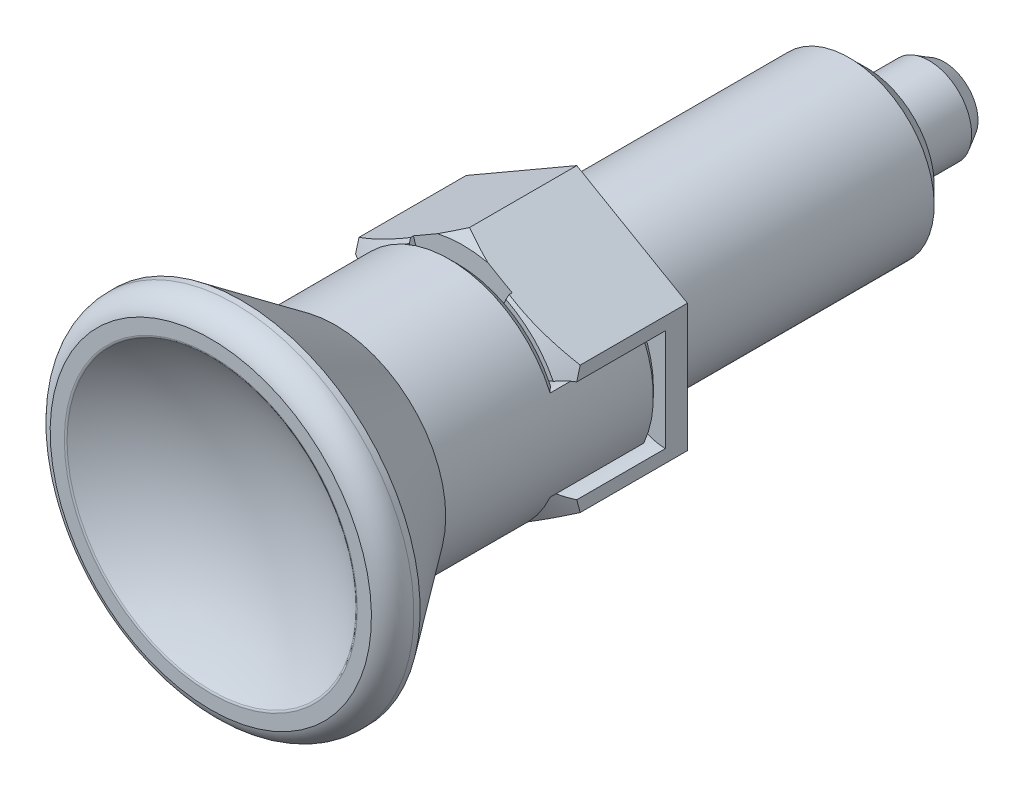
ISO-10303-21;
HEADER;
FILE_DESCRIPTION(('STEP AP214'),'2;1');
FILE_NAME('part.step','',(''),(''),'','','');
FILE_SCHEMA(('AUTOMOTIVE_DESIGN { 1 0 10303 214 1 1 1 1 }'));
ENDSEC;
DATA;
#1=APPLICATION_CONTEXT('core data for automotive mechanical design processes');
#2=APPLICATION_PROTOCOL_DEFINITION('international standard','automotive_design',2000,#1);
#3=PRODUCT_CONTEXT('',#1,'mechanical');
#4=PRODUCT('Part','Part','',(#3));
#5=PRODUCT_RELATED_PRODUCT_CATEGORY('part','',(#4));
#6=PRODUCT_DEFINITION_FORMATION('','',#4);
#7=PRODUCT_DEFINITION_CONTEXT('part definition',#1,'design');
#8=PRODUCT_DEFINITION('design','',#6,#7);
#9=PRODUCT_DEFINITION_SHAPE('','',#8);
#10=(LENGTH_UNIT() NAMED_UNIT(*) SI_UNIT(.MILLI.,.METRE.));
#11=(NAMED_UNIT(*) PLANE_ANGLE_UNIT() SI_UNIT($,.RADIAN.));
#12=(NAMED_UNIT(*) SI_UNIT($,.STERADIAN.) SOLID_ANGLE_UNIT());
#13=UNCERTAINTY_MEASURE_WITH_UNIT(LENGTH_MEASURE(1.E-05),#10,'distance_accuracy_value','');
#14=(GEOMETRIC_REPRESENTATION_CONTEXT(3) GLOBAL_UNCERTAINTY_ASSIGNED_CONTEXT((#13)) GLOBAL_UNIT_ASSIGNED_CONTEXT((#10,
#11,#12)) REPRESENTATION_CONTEXT('',''));
#15=CARTESIAN_POINT('',(0.,0.,0.));
#16=DIRECTION('',(0.,0.,1.));
#17=DIRECTION('',(1.,0.,0.));
#18=AXIS2_PLACEMENT_3D('',#15,#16,#17);
#19=CARTESIAN_POINT('',(3.10947441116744,3.10947441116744,-17.));
#20=DIRECTION('',(0.,0.,-1.));
#21=DIRECTION('',(0.,-1.,0.));
#22=AXIS2_PLACEMENT_3D('',#19,#20,#21);
#23=PLANE('',#22);
#24=CARTESIAN_POINT('',(0.,0.,-17.));
#25=DIRECTION('',(0.,0.,1.));
#26=DIRECTION('',(0.,-1.,0.));
#27=AXIS2_PLACEMENT_3D('',#24,#25,#26);
#28=CIRCLE('',#27,2.6);
#29=CARTESIAN_POINT('',(0.,-2.6,-17.));
#30=VERTEX_POINT('',#29);
#31=EDGE_CURVE('E24',#30,#30,#28,.T.);
#32=ORIENTED_EDGE('',*,*,#31,.T.);
#33=EDGE_LOOP('',(#32));
#34=FACE_BOUND('',#33,.T.);
#35=CARTESIAN_POINT('',(0.,0.,-17.));
#36=DIRECTION('',(0.,0.,-1.));
#37=DIRECTION('',(0.,-1.,0.));
#38=AXIS2_PLACEMENT_3D('',#35,#36,#37);
#39=CIRCLE('',#38,4.);
#40=CARTESIAN_POINT('',(0.,-4.,-17.));
#41=VERTEX_POINT('',#40);
#42=EDGE_CURVE('E1100',#41,#41,#39,.T.);
#43=ORIENTED_EDGE('',*,*,#42,.T.);
#44=EDGE_LOOP('',(#43));
#45=FACE_BOUND('',#44,.T.);
#46=ADVANCED_FACE('F14',(#34,#45),#23,.T.);
#47=CARTESIAN_POINT('',(0.,0.,-17.2));
#48=DIRECTION('',(0.,0.,-1.));
#49=DIRECTION('',(-1.,0.,0.));
#50=AXIS2_PLACEMENT_3D('',#47,#48,#49);
#51=TOROIDAL_SURFACE('',#50,2.59999999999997,0.199999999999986);
#52=ORIENTED_EDGE('',*,*,#31,.F.);
#53=EDGE_LOOP('',(#52));
#54=FACE_BOUND('',#53,.T.);
#55=CARTESIAN_POINT('',(0.,0.,-17.2));
#56=DIRECTION('',(0.,0.,1.));
#57=DIRECTION('',(0.,-1.,0.));
#58=AXIS2_PLACEMENT_3D('',#55,#56,#57);
#59=CIRCLE('',#58,2.4);
#60=CARTESIAN_POINT('',(0.,-2.4,-17.2));
#61=VERTEX_POINT('',#60);
#62=EDGE_CURVE('E750',#61,#61,#59,.T.);
#63=ORIENTED_EDGE('',*,*,#62,.T.);
#64=EDGE_LOOP('',(#63));
#65=FACE_BOUND('',#64,.T.);
#66=ADVANCED_FACE('F795',(#54,#65),#51,.F.);
#67=CARTESIAN_POINT('',(0.,0.,-17.2));
#68=DIRECTION('',(0.,0.,-1.));
#69=DIRECTION('',(0.,-1.,0.));
#70=AXIS2_PLACEMENT_3D('',#67,#68,#69);
#71=CYLINDRICAL_SURFACE('',#70,2.4);
#72=ORIENTED_EDGE('',*,*,#62,.F.);
#73=EDGE_LOOP('',(#72));
#74=FACE_BOUND('',#73,.T.);
#75=CARTESIAN_POINT('',(0.,0.,-17.2732050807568));
#76=DIRECTION('',(0.,0.,1.));
#77=DIRECTION('',(0.,-1.,0.));
#78=AXIS2_PLACEMENT_3D('',#75,#76,#77);
#79=CIRCLE('',#78,2.4);
#80=CARTESIAN_POINT('',(0.,-2.4,-17.2732050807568));
#81=VERTEX_POINT('',#80);
#82=EDGE_CURVE('E754',#81,#81,#79,.T.);
#83=ORIENTED_EDGE('',*,*,#82,.T.);
#84=EDGE_LOOP('',(#83));
#85=FACE_BOUND('',#84,.T.);
#86=ADVANCED_FACE('F797',(#74,#85),#71,.T.);
#87=CARTESIAN_POINT('',(0.,0.,-17.2732050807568));
#88=DIRECTION('',(0.,0.,-1.));
#89=DIRECTION('',(-1.,0.,0.));
#90=AXIS2_PLACEMENT_3D('',#87,#88,#89);
#91=TOROIDAL_SURFACE('',#90,2.59999999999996,0.199999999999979);
#92=ORIENTED_EDGE('',*,*,#82,.F.);
#93=EDGE_LOOP('',(#92));
#94=FACE_BOUND('',#93,.T.);
#95=CARTESIAN_POINT('',(0.,0.,-17.3732050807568));
#96=DIRECTION('',(0.,0.,1.));
#97=DIRECTION('',(0.,-1.,0.));
#98=AXIS2_PLACEMENT_3D('',#95,#96,#97);
#99=CIRCLE('',#98,2.42679491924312);
#100=CARTESIAN_POINT('',(0.,-2.42679491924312,-17.3732050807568));
#101=VERTEX_POINT('',#100);
#102=EDGE_CURVE('E758',#101,#101,#99,.T.);
#103=ORIENTED_EDGE('',*,*,#102,.T.);
#104=EDGE_LOOP('',(#103));
#105=FACE_BOUND('',#104,.T.);
#106=ADVANCED_FACE('F799',(#94,#105),#91,.F.);
#107=CARTESIAN_POINT('',(0.,0.,-17.3732050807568));
#108=DIRECTION('',(0.,0.,-1.));
#109=DIRECTION('',(0.,-1.,0.));
#110=AXIS2_PLACEMENT_3D('',#107,#108,#109);
#111=CONICAL_SURFACE('',#110,2.42679491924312,0.523598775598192);
#112=ORIENTED_EDGE('',*,*,#102,.F.);
#113=EDGE_LOOP('',(#112));
#114=FACE_BOUND('',#113,.T.);
#115=CARTESIAN_POINT('',(0.,0.,-17.5));
#116=DIRECTION('',(0.,0.,1.));
#117=DIRECTION('',(0.,-1.,0.));
#118=AXIS2_PLACEMENT_3D('',#115,#116,#117);
#119=CIRCLE('',#118,2.5);
#120=CARTESIAN_POINT('',(0.,-2.5,-17.5));
#121=VERTEX_POINT('',#120);
#122=EDGE_CURVE('E762',#121,#121,#119,.T.);
#123=ORIENTED_EDGE('',*,*,#122,.T.);
#124=EDGE_LOOP('',(#123));
#125=FACE_BOUND('',#124,.T.);
#126=ADVANCED_FACE('F801',(#114,#125),#111,.T.);
#127=CARTESIAN_POINT('',(0.,0.,-17.5));
#128=DIRECTION('',(0.,0.,-1.));
#129=DIRECTION('',(0.,-1.,0.));
#130=AXIS2_PLACEMENT_3D('',#127,#128,#129);
#131=CYLINDRICAL_SURFACE('',#130,2.5);
#132=ORIENTED_EDGE('',*,*,#122,.F.);
#133=EDGE_LOOP('',(#132));
#134=FACE_BOUND('',#133,.T.);
#135=CARTESIAN_POINT('',(0.,0.,-20.7));
#136=DIRECTION('',(0.,0.,1.));
#137=DIRECTION('',(0.,-1.,0.));
#138=AXIS2_PLACEMENT_3D('',#135,#136,#137);
#139=CIRCLE('',#138,2.5);
#140=CARTESIAN_POINT('',(0.,-2.5,-20.7));
#141=VERTEX_POINT('',#140);
#142=EDGE_CURVE('E766',#141,#141,#139,.T.);
#143=ORIENTED_EDGE('',*,*,#142,.T.);
#144=EDGE_LOOP('',(#143));
#145=FACE_BOUND('',#144,.T.);
#146=ADVANCED_FACE('F790',(#134,#145),#131,.T.);
#147=CARTESIAN_POINT('',(0.,0.,-21.588122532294));
#148=DIRECTION('',(0.,0.,1.));
#149=DIRECTION('',(0.,-1.,0.));
#150=AXIS2_PLACEMENT_3D('',#147,#148,#149);
#151=CONICAL_SURFACE('',#150,1.9872422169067,0.523598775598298);
#152=ORIENTED_EDGE('',*,*,#142,.F.);
#153=EDGE_LOOP('',(#152));
#154=FACE_BOUND('',#153,.T.);
#155=CARTESIAN_POINT('',(0.,0.,-21.588122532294));
#156=DIRECTION('',(0.,0.,1.));
#157=DIRECTION('',(0.,-1.,0.));
#158=AXIS2_PLACEMENT_3D('',#155,#156,#157);
#159=CIRCLE('',#158,1.9872422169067);
#160=CARTESIAN_POINT('',(0.,-1.9872422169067,-21.588122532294));
#161=VERTEX_POINT('',#160);
#162=EDGE_CURVE('E746',#161,#161,#159,.T.);
#163=ORIENTED_EDGE('',*,*,#162,.T.);
#164=EDGE_LOOP('',(#163));
#165=FACE_BOUND('',#164,.T.);
#166=ADVANCED_FACE('F777',(#154,#165),#151,.T.);
#167=CARTESIAN_POINT('',(0.,0.,-17.));
#168=DIRECTION('',(0.,0.,-1.));
#169=DIRECTION('',(0.,-1.,0.));
#170=AXIS2_PLACEMENT_3D('',#167,#168,#169);
#171=SPHERICAL_SURFACE('',#170,5.);
#172=ORIENTED_EDGE('',*,*,#162,.F.);
#173=EDGE_LOOP('',(#172));
#174=FACE_BOUND('',#173,.T.);
#175=ADVANCED_FACE('F779',(#174),#171,.T.);
#176=CARTESIAN_POINT('',(0.,-1.28703991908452E-09,32.599147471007));
#177=DIRECTION('',(0.,0.,-1.));
#178=DIRECTION('',(1.74532925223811E-06,-0.999999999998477,0.));
#179=AXIS2_PLACEMENT_3D('',#176,#177,#178);
#180=SPHERICAL_SURFACE('',#179,14.0000000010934);
#181=CARTESIAN_POINT('',(0.,4.8919202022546E-13,21.4645927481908));
#182=DIRECTION('',(0.,0.,1.));
#183=DIRECTION('',(1.74532925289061E-06,-0.999999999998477,0.));
#184=AXIS2_PLACEMENT_3D('',#181,#182,#183);
#185=CIRCLE('',#184,8.48655944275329);
#186=CARTESIAN_POINT('',(1.48118404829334E-05,-8.48655944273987,21.464592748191));
#187=VERTEX_POINT('',#186);
#188=EDGE_CURVE('E606',#187,#187,#185,.T.);
#189=ORIENTED_EDGE('',*,*,#188,.T.);
#190=EDGE_LOOP('',(#189));
#191=FACE_BOUND('',#190,.T.);
#192=ADVANCED_FACE('F781',(#191),#180,.F.);
#193=CARTESIAN_POINT('',(1.48118404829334E-05,-8.48655944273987,21.464592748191));
#194=CARTESIAN_POINT('',(1.49049371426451E-05,-8.53989989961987,21.5066671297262));
#195=CARTESIAN_POINT('',(1.50234382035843E-05,-8.60779600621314,21.5055276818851));
#196=CARTESIAN_POINT('',(-14.6991373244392,-8.48658509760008,21.464592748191));
#197=CARTESIAN_POINT('',(-14.7915256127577,-8.53992571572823,21.5066671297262));
#198=CARTESIAN_POINT('',(-14.9091250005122,-8.60782202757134,21.505527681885));
#199=CARTESIAN_POINT('',(-7.34958347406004,4.24326689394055,21.4645927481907));
#200=CARTESIAN_POINT('',(-7.39577771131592,4.26993704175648,21.506667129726));
#201=CARTESIAN_POINT('',(-7.45457752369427,4.30388499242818,21.5055276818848));
#202=CARTESIAN_POINT('',(-2.96236808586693E-05,16.9731188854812,21.4645927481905));
#203=CARTESIAN_POINT('',(-2.98098741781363E-05,17.0797997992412,21.5066671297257));
#204=CARTESIAN_POINT('',(-3.00468763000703E-05,17.2155920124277,21.5055276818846));
#205=CARTESIAN_POINT('',(7.34956866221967,4.24329254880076,21.4645927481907));
#206=CARTESIAN_POINT('',(7.39576280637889,4.26996285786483,21.506667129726));
#207=CARTESIAN_POINT('',(7.45456250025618,4.30391101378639,21.5055276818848));
#208=CARTESIAN_POINT('',(14.6991669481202,-8.48653378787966,21.464592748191));
#209=CARTESIAN_POINT('',(14.791555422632,-8.53987408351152,21.5066671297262));
#210=CARTESIAN_POINT('',(14.9091550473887,-8.60776998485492,21.505527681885));
#211=CARTESIAN_POINT('',(1.48118404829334E-05,-8.48655944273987,21.464592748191));
#212=CARTESIAN_POINT('',(1.49049371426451E-05,-8.53989989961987,21.5066671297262));
#213=CARTESIAN_POINT('',(1.50234382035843E-05,-8.60779600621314,21.5055276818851));
#214=(BOUNDED_SURFACE() B_SPLINE_SURFACE(2,2,((#193,#194,#195),(#196,#197,#198),(#199,#200,
#201),(#202,#203,#204),(#205,#206,#207),(#208,#209,#210),(#211,#212,#213)),.UNSPECIFIED.,.T.,
.F.,.F.) B_SPLINE_SURFACE_WITH_KNOTS((3,2,2,3),(3,3),(0.,217.869655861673,435.739311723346,
653.60896758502),(0.,1.),
.UNSPECIFIED.) GEOMETRIC_REPRESENTATION_ITEM() RATIONAL_B_SPLINE_SURFACE(((1.,0.946908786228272,
1.),(0.5,0.473454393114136,0.5),(1.,0.946908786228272,1.),(0.5,0.473454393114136,0.5),(1.,
0.946908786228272,1.),(0.5,0.473454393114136,0.5),(1.,0.946908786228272,1.))) REPRESENTATION_ITEM('') SURFACE());
#215=CARTESIAN_POINT('',(0.,4.77048955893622E-13,21.5055276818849));
#216=DIRECTION('',(0.,0.,-1.));
#217=DIRECTION('',(1.74532925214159E-06,-0.999999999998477,0.));
#218=AXIS2_PLACEMENT_3D('',#215,#216,#217);
#219=CIRCLE('',#218,8.60779600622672);
#220=CARTESIAN_POINT('',(1.50234382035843E-05,-8.60779600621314,21.5055276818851));
#221=VERTEX_POINT('',#220);
#222=EDGE_CURVE('E611',#221,#221,#219,.T.);
#223=CARTESIAN_POINT('',(1.48118404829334E-05,-8.48655944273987,21.464592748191));
#224=CARTESIAN_POINT('',(1.48136794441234E-05,-8.48761308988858,21.465423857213));
#225=CARTESIAN_POINT('',(1.48155335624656E-05,-8.48867542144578,21.4662439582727));
#226=CARTESIAN_POINT('',(1.48192760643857E-05,-8.49081971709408,21.4678637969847));
#227=CARTESIAN_POINT('',(1.4821164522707E-05,-8.49190172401,21.4686634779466));
#228=CARTESIAN_POINT('',(1.48249748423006E-05,-8.49408487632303,21.4702417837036));
#229=CARTESIAN_POINT('',(1.48268967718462E-05,-8.49518606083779,21.4710203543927));
#230=CARTESIAN_POINT('',(1.483077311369E-05,-8.49740704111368,21.4725557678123));
#231=CARTESIAN_POINT('',(1.4832727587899E-05,-8.49852687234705,21.4733125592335));
#232=CARTESIAN_POINT('',(1.48366680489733E-05,-8.50078459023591,21.4748037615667));
#233=CARTESIAN_POINT('',(1.48386540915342E-05,-8.5019225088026,21.4755381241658));
#234=CARTESIAN_POINT('',(1.4842656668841E-05,-8.50421581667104,21.4769838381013));
#235=CARTESIAN_POINT('',(1.4844673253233E-05,-8.50537123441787,21.4776951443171));
#236=CARTESIAN_POINT('',(1.48487358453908E-05,-8.50769892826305,21.4790941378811));
#237=CARTESIAN_POINT('',(1.48507818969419E-05,-8.50887122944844,21.4797817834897));
#238=CARTESIAN_POINT('',(1.48549023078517E-05,-8.51123205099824,21.4811328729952));
#239=CARTESIAN_POINT('',(1.48569767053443E-05,-8.51242059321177,21.4817962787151));
#240=CARTESIAN_POINT('',(1.48611526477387E-05,-8.51481323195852,21.4830983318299));
#241=CARTESIAN_POINT('',(1.48632542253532E-05,-8.51601734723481,21.4837369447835));
#242=CARTESIAN_POINT('',(1.48674833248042E-05,-8.51844044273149,21.4849888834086));
#243=CARTESIAN_POINT('',(1.4869610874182E-05,-8.51965943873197,21.4856021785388));
#244=CARTESIAN_POINT('',(1.4873890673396E-05,-8.52211158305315,21.4868029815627));
#245=CARTESIAN_POINT('',(1.48760429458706E-05,-8.52334474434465,21.4873904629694));
#246=CARTESIAN_POINT('',(1.48803709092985E-05,-8.52582448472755,21.4885391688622));
#247=CARTESIAN_POINT('',(1.48825466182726E-05,-8.52707107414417,21.4891003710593));
#248=CARTESIAN_POINT('',(1.48869201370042E-05,-8.52957691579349,21.4901960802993));
#249=CARTESIAN_POINT('',(1.4889117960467E-05,-8.53083617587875,21.4907305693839));
#250=CARTESIAN_POINT('',(1.48935343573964E-05,-8.53336658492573,21.4917724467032));
#251=CARTESIAN_POINT('',(1.48957529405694E-05,-8.53463773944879,21.4922798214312));
#252=CARTESIAN_POINT('',(1.49002094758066E-05,-8.53719114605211,21.4932670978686));
#253=CARTESIAN_POINT('',(1.49024474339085E-05,-8.53847340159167,21.4937469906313));
#254=CARTESIAN_POINT('',(1.49069413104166E-05,-8.54104820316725,21.4946789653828));
#255=CARTESIAN_POINT('',(1.49091972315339E-05,-8.54234075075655,21.4951310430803));
#256=CARTESIAN_POINT('',(1.49137256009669E-05,-8.5449353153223,21.4960070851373));
#257=CARTESIAN_POINT('',(1.49159980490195E-05,-8.54623733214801,21.4964310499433));
#258=CARTESIAN_POINT('',(1.49205580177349E-05,-8.54885000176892,21.4972505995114));
#259=CARTESIAN_POINT('',(1.4922845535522E-05,-8.55016065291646,21.4976461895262));
#260=CARTESIAN_POINT('',(1.49274341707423E-05,-8.55278974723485,21.4984087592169));
#261=CARTESIAN_POINT('',(1.49297352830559E-05,-8.55410818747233,21.4987757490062));
#262=CARTESIAN_POINT('',(1.49343496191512E-05,-8.55675200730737,21.4994809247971));
#263=CARTESIAN_POINT('',(1.49366628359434E-05,-8.55807738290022,21.4998191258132));
#264=CARTESIAN_POINT('',(1.49412998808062E-05,-8.5607342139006,21.5004665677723));
#265=CARTESIAN_POINT('',(1.49436237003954E-05,-8.56206566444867,21.5007758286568));
#266=CARTESIAN_POINT('',(1.49482804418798E-05,-8.56473378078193,21.5013652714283));
#267=CARTESIAN_POINT('',(1.4950613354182E-05,-8.56607044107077,21.5016454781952));
#268=CARTESIAN_POINT('',(1.49552867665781E-05,-8.56874810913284,21.5021767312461));
#269=CARTESIAN_POINT('',(1.4957627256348E-05,-8.57008911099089,21.5024278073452));
#270=CARTESIAN_POINT('',(1.4962314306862E-05,-8.57277459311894,21.5029007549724));
#271=CARTESIAN_POINT('',(1.49646608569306E-05,-8.5741190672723,21.5031226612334));
#272=CARTESIAN_POINT('',(1.49693585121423E-05,-8.57681062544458,21.5035372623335));
#273=CARTESIAN_POINT('',(1.49717096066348E-05,-8.57815770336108,21.5037299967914));
#274=CARTESIAN_POINT('',(1.49764148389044E-05,-8.58085360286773,21.5040862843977));
#275=CARTESIAN_POINT('',(1.49787689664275E-05,-8.58220241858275,21.5042498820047));
#276=CARTESIAN_POINT('',(1.49834787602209E-05,-8.58490093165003,21.5045479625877));
#277=CARTESIAN_POINT('',(1.49858344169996E-05,-8.58625062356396,21.504682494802));
#278=CARTESIAN_POINT('',(1.49905457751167E-05,-8.58895003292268,21.5049225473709));
#279=CARTESIAN_POINT('',(1.49929014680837E-05,-8.59029974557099,21.5050281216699));
#280=CARTESIAN_POINT('',(1.49976114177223E-05,-8.59299834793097,21.5052103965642));
#281=CARTESIAN_POINT('',(1.49999656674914E-05,-8.59434723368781,21.5052871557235));
#282=CARTESIAN_POINT('',(1.50046712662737E-05,-8.59704334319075,21.5054119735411));
#283=CARTESIAN_POINT('',(1.50070226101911E-05,-8.59839056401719,21.5054600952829));
#284=CARTESIAN_POINT('',(1.50117209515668E-05,-8.60108251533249,21.5055278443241));
#285=CARTESIAN_POINT('',(1.50140679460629E-05,-8.60242724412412,21.5055475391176));
#286=CARTESIAN_POINT('',(1.50187561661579E-05,-8.60511339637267,21.5055586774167));
#287=CARTESIAN_POINT('',(1.50210973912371E-05,-8.60645481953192,21.5055501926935));
#288=CARTESIAN_POINT('',(1.50234382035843E-05,-8.60779600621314,21.5055276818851));
#289=B_SPLINE_CURVE_WITH_KNOTS('',3,(#223,#224,#225,#226,#227,#228,#229,#230,#231,#232,#233,
#234,#235,#236,#237,#238,#239,#240,#241,#242,#243,#244,#245,#246,#247,#248,#249,#250,#251,#252,
#253,#254,#255,#256,#257,#258,#259,#260,#261,#262,#263,#264,#265,#266,#267,#268,#269,#270,#271,
#272,#273,#274,#275,#276,#277,#278,#279,#280,#281,#282,#283,#284,#285,#286,#287,#288),
.UNSPECIFIED.,.F.,.F.,(4,2,2,2,2,2,2,2,2,2,2,2,2,2,2,2,2,2,2,2,2,2,2,2,2,2,2,2,2,2,2,2,4),(0.,
0.00402587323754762,0.00806191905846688,0.0121074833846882,0.0161619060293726,
0.0202245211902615,0.0242946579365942,0.0283716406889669,0.0324547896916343,0.0365434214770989,
0.0406368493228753,0.0447343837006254,0.0488353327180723,0.0529390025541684,0.0570446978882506,
0.0611517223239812,0.0652593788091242,0.0693669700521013,0.0734737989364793,0.0775791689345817,
0.0816823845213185,0.0857827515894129,0.0898795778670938,0.0939721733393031,0.0980598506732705,
0.10214192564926,0.106217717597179,0.110286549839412,0.114347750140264,0.118400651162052,
0.122444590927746,0.126478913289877,0.130502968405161),.UNSPECIFIED.);
#290=EDGE_CURVE('BSEAM789',#187,#221,#289,.T.);
#291=ORIENTED_EDGE('',*,*,#188,.F.);
#292=ORIENTED_EDGE('',*,*,#222,.F.);
#293=ORIENTED_EDGE('',*,*,#290,.T.);
#294=ORIENTED_EDGE('',*,*,#290,.F.);
#295=EDGE_LOOP('',(#291,#293,#292,#294));
#296=FACE_BOUND('',#295,.T.);
#297=ADVANCED_FACE('F789',(#296),#214,.T.);
#298=CARTESIAN_POINT('',(-10.3840181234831,10.3839818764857,21.5055276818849));
#299=DIRECTION('',(0.,0.,1.));
#300=DIRECTION('',(1.74532925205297E-06,-0.999999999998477,0.));
#301=AXIS2_PLACEMENT_3D('',#298,#299,#300);
#302=PLANE('',#301);
#303=CARTESIAN_POINT('',(0.,4.77048955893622E-13,21.5055276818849));
#304=DIRECTION('',(0.,0.,-1.));
#305=DIRECTION('',(1.74532925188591E-06,-0.999999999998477,0.));
#306=AXIS2_PLACEMENT_3D('',#303,#304,#305);
#307=CIRCLE('',#306,9.44);
#308=CARTESIAN_POINT('',(1.64759081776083E-05,-9.43999999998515,21.5055276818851));
#309=VERTEX_POINT('',#308);
#310=EDGE_CURVE('E619',#309,#309,#307,.T.);
#311=ORIENTED_EDGE('',*,*,#310,.F.);
#312=EDGE_LOOP('',(#311));
#313=FACE_BOUND('',#312,.T.);
#314=ORIENTED_EDGE('',*,*,#222,.T.);
#315=EDGE_LOOP('',(#314));
#316=FACE_BOUND('',#315,.T.);
#317=ADVANCED_FACE('F1584',(#313,#316),#302,.T.);
#318=CARTESIAN_POINT('',(0.,4.54497550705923E-13,20.0715123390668));
#319=DIRECTION('',(0.,0.,-1.));
#320=DIRECTION('',(0.,1.,0.));
#321=AXIS2_PLACEMENT_3D('',#318,#319,#320);
#322=TOROIDAL_SURFACE('',#321,8.99999999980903,1.50000000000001);
#323=ORIENTED_EDGE('',*,*,#310,.T.);
#324=EDGE_LOOP('',(#323));
#325=FACE_BOUND('',#324,.T.);
#326=CARTESIAN_POINT('',(0.,4.54497550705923E-13,20.0715123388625));
#327=DIRECTION('',(0.,0.,-1.));
#328=DIRECTION('',(1.74532925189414E-06,-0.999999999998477,0.));
#329=AXIS2_PLACEMENT_3D('',#326,#327,#328);
#330=CIRCLE('',#329,10.499999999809);
#331=CARTESIAN_POINT('',(1.83259571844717E-05,-10.4999999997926,20.0715123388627));
#332=VERTEX_POINT('',#331);
#333=EDGE_CURVE('E626',#332,#332,#330,.T.);
#334=ORIENTED_EDGE('',*,*,#333,.F.);
#335=EDGE_LOOP('',(#334));
#336=FACE_BOUND('',#335,.T.);
#337=ADVANCED_FACE('F16',(#325,#336),#322,.T.);
#338=CARTESIAN_POINT('',(0.,4.55921975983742E-13,20.0715123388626));
#339=DIRECTION('',(0.,0.,-1.));
#340=DIRECTION('',(1.74532925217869E-06,-0.999999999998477,0.));
#341=AXIS2_PLACEMENT_3D('',#338,#339,#340);
#342=CYLINDRICAL_SURFACE('',#341,10.5);
#343=ORIENTED_EDGE('',*,*,#333,.T.);
#344=EDGE_LOOP('',(#343));
#345=FACE_BOUND('',#344,.T.);
#346=CARTESIAN_POINT('',(0.,4.49293380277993E-13,19.7055276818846));
#347=DIRECTION('',(0.,0.,-1.));
#348=DIRECTION('',(1.74532925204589E-06,-0.999999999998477,0.));
#349=AXIS2_PLACEMENT_3D('',#346,#347,#348);
#350=CIRCLE('',#349,10.5);
#351=CARTESIAN_POINT('',(1.83259571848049E-05,-10.4999999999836,19.7055276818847));
#352=VERTEX_POINT('',#351);
#353=EDGE_CURVE('E631',#352,#352,#350,.T.);
#354=ORIENTED_EDGE('',*,*,#353,.F.);
#355=EDGE_LOOP('',(#354));
#356=FACE_BOUND('',#355,.T.);
#357=ADVANCED_FACE('F1608',(#345,#356),#342,.T.);
#358=CARTESIAN_POINT('',(7.5,-9.9,0.));
#359=DIRECTION('',(0.,0.,-1.));
#360=DIRECTION('',(-1.,0.,0.));
#361=AXIS2_PLACEMENT_3D('',#358,#359,#360);
#362=PLANE('',#361);
#363=DIRECTION('',(0.,1.,0.));
#364=VECTOR('',#363,1.);
#365=CARTESIAN_POINT('',(-6.5,-3.75277674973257,0.));
#366=LINE('',#365,#364);
#367=CARTESIAN_POINT('',(-6.5,-3.75277674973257,0.));
#368=VERTEX_POINT('',#367);
#369=CARTESIAN_POINT('',(-6.5,3.75277674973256,0.));
#370=VERTEX_POINT('',#369);
#371=EDGE_CURVE('E1232',#368,#370,#366,.T.);
#372=ORIENTED_EDGE('',*,*,#371,.T.);
#373=DIRECTION('',(0.866025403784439,0.5,0.));
#374=VECTOR('',#373,1.);
#375=CARTESIAN_POINT('',(-6.5,3.75277674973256,0.));
#376=LINE('',#375,#374);
#377=CARTESIAN_POINT('',(0.,7.50555349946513,0.));
#378=VERTEX_POINT('',#377);
#379=EDGE_CURVE('E1261',#370,#378,#376,.T.);
#380=ORIENTED_EDGE('',*,*,#379,.T.);
#381=DIRECTION('',(0.866025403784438,-0.5,0.));
#382=VECTOR('',#381,1.);
#383=CARTESIAN_POINT('',(0.,7.50555349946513,0.));
#384=LINE('',#383,#382);
#385=CARTESIAN_POINT('',(6.5,3.75277674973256,0.));
#386=VERTEX_POINT('',#385);
#387=EDGE_CURVE('E1323',#378,#386,#384,.T.);
#388=ORIENTED_EDGE('',*,*,#387,.T.);
#389=DIRECTION('',(0.,-1.,0.));
#390=VECTOR('',#389,1.);
#391=CARTESIAN_POINT('',(6.5,3.75277674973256,0.));
#392=LINE('',#391,#390);
#393=CARTESIAN_POINT('',(6.5,-3.75277674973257,0.));
#394=VERTEX_POINT('',#393);
#395=EDGE_CURVE('E1266',#386,#394,#392,.T.);
#396=ORIENTED_EDGE('',*,*,#395,.T.);
#397=DIRECTION('',(-0.866025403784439,-0.5,0.));
#398=VECTOR('',#397,1.);
#399=CARTESIAN_POINT('',(6.5,-3.75277674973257,0.));
#400=LINE('',#399,#398);
#401=CARTESIAN_POINT('',(0.,-7.50555349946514,0.));
#402=VERTEX_POINT('',#401);
#403=EDGE_CURVE('E1262',#394,#402,#400,.T.);
#404=ORIENTED_EDGE('',*,*,#403,.T.);
#405=DIRECTION('',(-0.866025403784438,0.5,0.));
#406=VECTOR('',#405,1.);
#407=CARTESIAN_POINT('',(0.,-7.50555349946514,0.));
#408=LINE('',#407,#406);
#409=EDGE_CURVE('E1267',#402,#368,#408,.T.);
#410=ORIENTED_EDGE('',*,*,#409,.T.);
#411=EDGE_LOOP('',(#372,#380,#388,#396,#404,#410));
#412=FACE_BOUND('',#411,.T.);
#413=CARTESIAN_POINT('',(0.,0.,0.));
#414=DIRECTION('',(0.,0.,1.));
#415=DIRECTION('',(0.,-1.,0.));
#416=AXIS2_PLACEMENT_3D('',#413,#414,#415);
#417=CIRCLE('',#416,5.);
#418=CARTESIAN_POINT('',(0.,-5.,0.));
#419=VERTEX_POINT('',#418);
#420=EDGE_CURVE('E1270',#419,#419,#417,.T.);
#421=ORIENTED_EDGE('',*,*,#420,.T.);
#422=EDGE_LOOP('',(#421));
#423=FACE_BOUND('',#422,.T.);
#424=ADVANCED_FACE('F1324',(#412,#423),#362,.T.);
#425=CARTESIAN_POINT('',(0.,3.47311272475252E-13,14.2));
#426=DIRECTION('',(0.,0.,1.));
#427=DIRECTION('',(1.74532925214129E-06,-0.999999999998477,0.));
#428=AXIS2_PLACEMENT_3D('',#425,#426,#427);
#429=CONICAL_SURFACE('',#428,6.50000000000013,0.628318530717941);
#430=ORIENTED_EDGE('',*,*,#353,.T.);
#431=EDGE_LOOP('',(#430));
#432=FACE_BOUND('',#431,.T.);
#433=CARTESIAN_POINT('',(0.,3.60822483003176E-13,14.2));
#434=DIRECTION('',(0.,0.,1.));
#435=DIRECTION('',(1.74532925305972E-06,-0.999999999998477,0.));
#436=AXIS2_PLACEMENT_3D('',#433,#434,#435);
#437=CIRCLE('',#436,6.50000000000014);
#438=CARTESIAN_POINT('',(1.13446401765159E-05,-6.49999999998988,14.2000000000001));
#439=VERTEX_POINT('',#438);
#440=EDGE_CURVE('E630',#439,#439,#437,.T.);
#441=ORIENTED_EDGE('',*,*,#440,.T.);
#442=EDGE_LOOP('',(#441));
#443=FACE_BOUND('',#442,.T.);
#444=ADVANCED_FACE('F1631',(#432,#443),#429,.T.);
#445=CARTESIAN_POINT('',(-6.5,3.75277674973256,7.));
#446=DIRECTION('',(1.,0.,0.));
#447=DIRECTION('',(0.,-1.,0.));
#448=AXIS2_PLACEMENT_3D('',#445,#446,#447);
#449=PLANE('',#448);
#450=DIRECTION('',(0.,-1.,0.));
#451=VECTOR('',#450,1.);
#452=CARTESIAN_POINT('',(-6.5,2.99833287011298,1.3));
#453=LINE('',#452,#451);
#454=CARTESIAN_POINT('',(-6.5,2.99833287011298,1.3));
#455=VERTEX_POINT('',#454);
#456=CARTESIAN_POINT('',(-6.5,-2.998332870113,1.3));
#457=VERTEX_POINT('',#456);
#458=EDGE_CURVE('E1275',#455,#457,#453,.T.);
#459=ORIENTED_EDGE('',*,*,#458,.F.);
#460=DIRECTION('',(0.,0.,-1.));
#461=VECTOR('',#460,1.);
#462=CARTESIAN_POINT('',(-6.5,2.99833287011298,6.500537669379));
#463=LINE('',#462,#461);
#464=CARTESIAN_POINT('',(-6.5,2.99833287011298,6.500537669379));
#465=VERTEX_POINT('',#464);
#466=EDGE_CURVE('E955',#465,#455,#463,.T.);
#467=ORIENTED_EDGE('',*,*,#466,.F.);
#468=CARTESIAN_POINT('',(-6.5,2.99833287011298,6.50053766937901));
#469=CARTESIAN_POINT('',(-6.5,3.36661953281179,6.41147398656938));
#470=CARTESIAN_POINT('',(-6.5,3.75277674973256,6.3));
#471=(BOUNDED_CURVE() B_SPLINE_CURVE(2,(#468,#469,#470),.UNSPECIFIED.,.F.,
.F.) B_SPLINE_CURVE_WITH_KNOTS((3,3),(0.,0.0903588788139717),
.UNSPECIFIED.) CURVE() GEOMETRIC_REPRESENTATION_ITEM() RATIONAL_B_SPLINE_CURVE((1.02543095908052,
1.01397856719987,1.)) REPRESENTATION_ITEM(''));
#472=CARTESIAN_POINT('',(-6.5,3.75277674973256,6.3));
#473=VERTEX_POINT('',#472);
#474=EDGE_CURVE('E1274',#465,#473,#471,.T.);
#475=ORIENTED_EDGE('',*,*,#474,.T.);
#476=DIRECTION('',(0.,0.,-1.));
#477=VECTOR('',#476,1.);
#478=CARTESIAN_POINT('',(-6.5,3.75277674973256,6.3));
#479=LINE('',#478,#477);
#480=EDGE_CURVE('E1253',#473,#370,#479,.T.);
#481=ORIENTED_EDGE('',*,*,#480,.T.);
#482=ORIENTED_EDGE('',*,*,#371,.F.);
#483=DIRECTION('',(0.,0.,1.));
#484=VECTOR('',#483,1.);
#485=CARTESIAN_POINT('',(-6.5,-3.75277674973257,0.));
#486=LINE('',#485,#484);
#487=CARTESIAN_POINT('',(-6.5,-3.75277674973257,6.3));
#488=VERTEX_POINT('',#487);
#489=EDGE_CURVE('E963',#368,#488,#486,.T.);
#490=ORIENTED_EDGE('',*,*,#489,.T.);
#491=CARTESIAN_POINT('',(-6.5,-3.75277674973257,6.3));
#492=CARTESIAN_POINT('',(-6.5,-3.3666195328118,6.41147398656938));
#493=CARTESIAN_POINT('',(-6.5,-2.998332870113,6.50053766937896));
#494=(BOUNDED_CURVE() B_SPLINE_CURVE(2,(#491,#492,#493),.UNSPECIFIED.,.F.,
.F.) B_SPLINE_CURVE_WITH_KNOTS((3,3),(0.90964112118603,1.),
.UNSPECIFIED.) CURVE() GEOMETRIC_REPRESENTATION_ITEM() RATIONAL_B_SPLINE_CURVE((1.,
1.01397856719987,1.02543095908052)) REPRESENTATION_ITEM(''));
#495=CARTESIAN_POINT('',(-6.5,-2.998332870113,6.500537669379));
#496=VERTEX_POINT('',#495);
#497=EDGE_CURVE('E959',#488,#496,#494,.T.);
#498=ORIENTED_EDGE('',*,*,#497,.T.);
#499=DIRECTION('',(0.,0.,1.));
#500=VECTOR('',#499,1.);
#501=CARTESIAN_POINT('',(-6.5,-2.998332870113,1.3));
#502=LINE('',#501,#500);
#503=EDGE_CURVE('E947',#457,#496,#502,.T.);
#504=ORIENTED_EDGE('',*,*,#503,.F.);
#505=EDGE_LOOP('',(#459,#467,#475,#481,#482,#490,#498,#504));
#506=FACE_BOUND('',#505,.T.);
#507=ADVANCED_FACE('F876',(#506),#449,.F.);
#508=CARTESIAN_POINT('',(0.,0.,7.));
#509=DIRECTION('',(0.,0.,-1.));
#510=DIRECTION('',(0.,-1.,0.));
#511=AXIS2_PLACEMENT_3D('',#508,#509,#510);
#512=CONICAL_SURFACE('',#511,6.29311793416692,1.0471975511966);
#513=CARTESIAN_POINT('',(1.48294029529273,6.64937752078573,6.69999999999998));
#514=CARTESIAN_POINT('',(0.777347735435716,7.05675157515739,6.55911591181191));
#515=CARTESIAN_POINT('',(0.,7.50555349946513,6.3));
#516=(BOUNDED_CURVE() B_SPLINE_CURVE(2,(#513,#514,#515),.UNSPECIFIED.,.F.,
.F.) B_SPLINE_CURVE_WITH_KNOTS((3,3),(0.786003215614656,1.),
.UNSPECIFIED.) CURVE() GEOMETRIC_REPRESENTATION_ITEM() RATIONAL_B_SPLINE_CURVE((1.05204192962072,
1.03310541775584,1.)) REPRESENTATION_ITEM(''));
#517=CARTESIAN_POINT('',(1.48294029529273,6.64937752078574,6.7));
#518=VERTEX_POINT('',#517);
#519=CARTESIAN_POINT('',(0.,7.50555349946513,6.3));
#520=VERTEX_POINT('',#519);
#521=EDGE_CURVE('E1214',#518,#520,#516,.T.);
#522=ORIENTED_EDGE('',*,*,#521,.T.);
#523=CARTESIAN_POINT('',(0.,7.50555349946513,6.3));
#524=CARTESIAN_POINT('',(-0.777347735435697,7.05675157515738,6.55911591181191));
#525=CARTESIAN_POINT('',(-1.48294029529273,6.64937752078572,6.70000000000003));
#526=(BOUNDED_CURVE() B_SPLINE_CURVE(2,(#523,#524,#525),.UNSPECIFIED.,.F.,
.F.) B_SPLINE_CURVE_WITH_KNOTS((3,3),(0.,0.213996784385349),
.UNSPECIFIED.) CURVE() GEOMETRIC_REPRESENTATION_ITEM() RATIONAL_B_SPLINE_CURVE((1.,
1.03310541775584,1.05204192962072)) REPRESENTATION_ITEM(''));
#527=CARTESIAN_POINT('',(-1.48294029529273,6.64937752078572,6.7));
#528=VERTEX_POINT('',#527);
#529=EDGE_CURVE('E1224',#520,#528,#526,.T.);
#530=ORIENTED_EDGE('',*,*,#529,.T.);
#531=CARTESIAN_POINT('',(0.,0.,6.7));
#532=DIRECTION('',(0.,0.,-1.));
#533=DIRECTION('',(-0.217671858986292,0.976022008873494,0.));
#534=AXIS2_PLACEMENT_3D('',#531,#532,#533);
#535=CIRCLE('',#534,6.81273317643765);
#536=EDGE_CURVE('E2329',#528,#518,#535,.T.);
#537=ORIENTED_EDGE('',*,*,#536,.T.);
#538=EDGE_LOOP('',(#522,#530,#537));
#539=FACE_BOUND('',#538,.T.);
#540=ADVANCED_FACE('F923',(#539),#512,.T.);
#541=CARTESIAN_POINT('',(7.5,7.29311793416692,7.));
#542=DIRECTION('',(0.,0.,1.));
#543=DIRECTION('',(-1.,0.,0.));
#544=AXIS2_PLACEMENT_3D('',#541,#542,#543);
#545=PLANE('',#544);
#546=CARTESIAN_POINT('',(0.,2.3189592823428E-13,7.));
#547=DIRECTION('',(0.,0.,1.));
#548=DIRECTION('',(-1.,0.,0.));
#549=AXIS2_PLACEMENT_3D('',#546,#547,#548);
#550=CIRCLE('',#549,5.99999999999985);
#551=CARTESIAN_POINT('',(-2.72509003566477,5.34545454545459,7.));
#552=VERTEX_POINT('',#551);
#553=CARTESIAN_POINT('',(-5.34545454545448,2.72509003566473,6.99999999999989));
#554=VERTEX_POINT('',#553);
#555=EDGE_CURVE('E730',#552,#554,#550,.T.);
#556=ORIENTED_EDGE('',*,*,#555,.F.);
#557=CARTESIAN_POINT('',(0.,6.6,7.));
#558=DIRECTION('',(0.,0.,-1.));
#559=DIRECTION('',(0.944959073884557,-0.327188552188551,0.));
#560=AXIS2_PLACEMENT_3D('',#557,#558,#559);
#561=CIRCLE('',#560,3.);
#562=CARTESIAN_POINT('',(-2.83487722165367,5.61843434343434,7.));
#563=VERTEX_POINT('',#562);
#564=EDGE_CURVE('E1182',#552,#563,#561,.T.);
#565=ORIENTED_EDGE('',*,*,#564,.T.);
#566=CARTESIAN_POINT('',(0.,0.,7.));
#567=DIRECTION('',(0.,0.,1.));
#568=DIRECTION('',(-0.450472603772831,0.892790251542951,0.));
#569=AXIS2_PLACEMENT_3D('',#566,#567,#568);
#570=CIRCLE('',#569,6.29311793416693);
#571=CARTESIAN_POINT('',(-5.61843434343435,2.83487722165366,7.));
#572=VERTEX_POINT('',#571);
#573=EDGE_CURVE('E907',#563,#572,#570,.T.);
#574=ORIENTED_EDGE('',*,*,#573,.T.);
#575=CARTESIAN_POINT('',(-6.6,0.,7.));
#576=DIRECTION('',(0.,0.,-1.));
#577=DIRECTION('',(0.327188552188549,0.944959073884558,0.));
#578=AXIS2_PLACEMENT_3D('',#575,#576,#577);
#579=CIRCLE('',#578,3.00000000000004);
#580=EDGE_CURVE('E968',#572,#554,#579,.T.);
#581=ORIENTED_EDGE('',*,*,#580,.T.);
#582=EDGE_LOOP('',(#556,#565,#574,#581));
#583=FACE_BOUND('',#582,.T.);
#584=ADVANCED_FACE('F869',(#583),#545,.T.);
#585=ORIENTED_EDGE('',*,*,#573,.F.);
#586=CARTESIAN_POINT('',(-2.83487722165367,5.61843434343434,7.));
#587=CARTESIAN_POINT('',(-2.85914346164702,5.68851810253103,6.9575639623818));
#588=CARTESIAN_POINT('',(-2.88078570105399,5.75940223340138,6.9153844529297));
#589=CARTESIAN_POINT('',(-2.89985114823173,5.83132365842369,6.8733035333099));
#590=B_SPLINE_CURVE_WITH_KNOTS('',3,(#586,#587,#588,#589),.UNSPECIFIED.,.F.,.F.,(4,4),(0.,
0.41902559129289),.UNSPECIFIED.);
#591=CARTESIAN_POINT('',(-2.89985114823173,5.83132365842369,6.8733035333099));
#592=VERTEX_POINT('',#591);
#593=EDGE_CURVE('E1233',#563,#592,#590,.T.);
#594=ORIENTED_EDGE('',*,*,#593,.T.);
#595=CARTESIAN_POINT('',(-2.89985114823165,5.83132365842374,6.87330353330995));
#596=CARTESIAN_POINT('',(-4.57241504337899,4.86566844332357,6.94252831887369));
#597=CARTESIAN_POINT('',(-6.5,3.75277674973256,6.3));
#598=(BOUNDED_CURVE() B_SPLINE_CURVE(2,(#595,#596,#597),.UNSPECIFIED.,.F.,
.F.) B_SPLINE_CURVE_WITH_KNOTS((3,3),(0.442020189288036,1.),
.UNSPECIFIED.) CURVE() GEOMETRIC_REPRESENTATION_ITEM() RATIONAL_B_SPLINE_CURVE((1.07631016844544,
1.08631977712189,1.)) REPRESENTATION_ITEM(''));
#599=EDGE_CURVE('E973',#592,#473,#598,.T.);
#600=ORIENTED_EDGE('',*,*,#599,.T.);
#601=ORIENTED_EDGE('',*,*,#474,.F.);
#602=CARTESIAN_POINT('',(-5.61843434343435,2.83487722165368,7.00000000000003));
#603=CARTESIAN_POINT('',(-5.65814550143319,2.8486274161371,6.97595512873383));
#604=CARTESIAN_POINT('',(-5.69817737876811,2.86155349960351,6.95196831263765));
#605=CARTESIAN_POINT('',(-5.77750414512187,2.88533502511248,6.90490580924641));
#606=CARTESIAN_POINT('',(-5.81678042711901,2.89624429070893,6.88182594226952));
#607=CARTESIAN_POINT('',(-5.89448565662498,2.91612813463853,6.83657714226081));
#608=CARTESIAN_POINT('',(-5.9328984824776,2.92515556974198,6.81440374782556));
#609=CARTESIAN_POINT('',(-6.00877939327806,2.94141304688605,6.77096833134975));
#610=CARTESIAN_POINT('',(-6.04623365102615,2.94869483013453,6.74970151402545));
#611=CARTESIAN_POINT('',(-6.12011232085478,2.96159799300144,6.70807954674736));
#612=CARTESIAN_POINT('',(-6.15652500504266,2.96726988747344,6.68771923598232));
#613=CARTESIAN_POINT('',(-6.22824701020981,2.97708922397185,6.64791074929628));
#614=CARTESIAN_POINT('',(-6.26354650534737,2.98128585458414,6.62845699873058));
#615=CARTESIAN_POINT('',(-6.33297931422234,2.98828873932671,6.5904618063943));
#616=CARTESIAN_POINT('',(-6.36710451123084,2.99114277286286,6.57191433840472));
#617=CARTESIAN_POINT('',(-6.43413630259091,2.99559198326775,6.53573310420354));
#618=CARTESIAN_POINT('',(-6.46703627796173,2.99723346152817,6.51809275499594));
#619=CARTESIAN_POINT('',(-6.50000000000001,2.99833287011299,6.50053766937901));
#620=B_SPLINE_CURVE_WITH_KNOTS('',3,(#602,#603,#604,#605,#606,#607,#608,#609,#610,#611,#612,
#613,#614,#615,#616,#617,#618,#619),.UNSPECIFIED.,.F.,.F.,(4,2,2,2,2,2,2,2,4),(0.,
0.14524284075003,0.285743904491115,0.421504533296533,0.552526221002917,0.678810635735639,
0.80035964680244,0.917175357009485,1.02926014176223),.UNSPECIFIED.);
#621=EDGE_CURVE('E901',#572,#465,#620,.T.);
#622=ORIENTED_EDGE('',*,*,#621,.F.);
#623=EDGE_LOOP('',(#585,#594,#600,#601,#622));
#624=FACE_BOUND('',#623,.T.);
#625=ADVANCED_FACE('F1667',(#624),#512,.T.);
#626=CARTESIAN_POINT('',(0.,7.50555349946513,7.));
#627=DIRECTION('',(0.5,-0.866025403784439,0.));
#628=DIRECTION('',(-0.866025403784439,-0.5,0.));
#629=AXIS2_PLACEMENT_3D('',#626,#627,#628);
#630=PLANE('',#629);
#631=DIRECTION('',(0.86602540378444,0.5,0.));
#632=VECTOR('',#631,1.);
#633=CARTESIAN_POINT('',(-2.89985114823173,5.83132365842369,6.7));
#634=LINE('',#633,#632);
#635=CARTESIAN_POINT('',(-2.89985114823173,5.83132365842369,6.7));
#636=VERTEX_POINT('',#635);
#637=EDGE_CURVE('E1212',#636,#528,#634,.T.);
#638=ORIENTED_EDGE('',*,*,#637,.T.);
#639=ORIENTED_EDGE('',*,*,#529,.F.);
#640=DIRECTION('',(0.,0.,-1.));
#641=VECTOR('',#640,1.);
#642=CARTESIAN_POINT('',(0.,7.50555349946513,6.3));
#643=LINE('',#642,#641);
#644=EDGE_CURVE('E1231',#520,#378,#643,.T.);
#645=ORIENTED_EDGE('',*,*,#644,.T.);
#646=ORIENTED_EDGE('',*,*,#379,.F.);
#647=ORIENTED_EDGE('',*,*,#480,.F.);
#648=ORIENTED_EDGE('',*,*,#599,.F.);
#649=DIRECTION('',(0.,0.,-1.));
#650=VECTOR('',#649,1.);
#651=CARTESIAN_POINT('',(-2.89985114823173,5.83132365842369,6.8733035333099));
#652=LINE('',#651,#650);
#653=EDGE_CURVE('E1229',#592,#636,#652,.T.);
#654=ORIENTED_EDGE('',*,*,#653,.T.);
#655=EDGE_LOOP('',(#638,#639,#645,#646,#647,#648,#654));
#656=FACE_BOUND('',#655,.T.);
#657=ADVANCED_FACE('F1318',(#656),#630,.F.);
#658=CARTESIAN_POINT('',(6.5,3.75277674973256,7.));
#659=DIRECTION('',(-0.5,-0.866025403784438,0.));
#660=DIRECTION('',(-0.866025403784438,0.5,0.));
#661=AXIS2_PLACEMENT_3D('',#658,#659,#660);
#662=PLANE('',#661);
#663=CARTESIAN_POINT('',(6.5,3.75277674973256,6.3));
#664=CARTESIAN_POINT('',(4.572415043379,4.86566844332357,6.94252831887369));
#665=CARTESIAN_POINT('',(2.89985114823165,5.83132365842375,6.8733035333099));
#666=(BOUNDED_CURVE() B_SPLINE_CURVE(2,(#663,#664,#665),.UNSPECIFIED.,.F.,
.F.) B_SPLINE_CURVE_WITH_KNOTS((3,3),(0.,0.557979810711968),
.UNSPECIFIED.) CURVE() GEOMETRIC_REPRESENTATION_ITEM() RATIONAL_B_SPLINE_CURVE((1.,
1.08631977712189,1.07631016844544)) REPRESENTATION_ITEM(''));
#667=CARTESIAN_POINT('',(6.5,3.75277674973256,6.3));
#668=VERTEX_POINT('',#667);
#669=CARTESIAN_POINT('',(2.89985114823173,5.8313236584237,6.8733035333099));
#670=VERTEX_POINT('',#669);
#671=EDGE_CURVE('E2251',#668,#670,#666,.T.);
#672=ORIENTED_EDGE('',*,*,#671,.F.);
#673=DIRECTION('',(0.,0.,1.));
#674=VECTOR('',#673,1.);
#675=CARTESIAN_POINT('',(6.5,3.75277674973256,0.));
#676=LINE('',#675,#674);
#677=EDGE_CURVE('E2216',#386,#668,#676,.T.);
#678=ORIENTED_EDGE('',*,*,#677,.F.);
#679=ORIENTED_EDGE('',*,*,#387,.F.);
#680=ORIENTED_EDGE('',*,*,#644,.F.);
#681=ORIENTED_EDGE('',*,*,#521,.F.);
#682=DIRECTION('',(0.866025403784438,-0.5,0.));
#683=VECTOR('',#682,1.);
#684=CARTESIAN_POINT('',(1.48294029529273,6.64937752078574,6.7));
#685=LINE('',#684,#683);
#686=CARTESIAN_POINT('',(2.89985114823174,5.8313236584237,6.7));
#687=VERTEX_POINT('',#686);
#688=EDGE_CURVE('E2263',#518,#687,#685,.T.);
#689=ORIENTED_EDGE('',*,*,#688,.T.);
#690=DIRECTION('',(0.,0.,1.));
#691=VECTOR('',#690,1.);
#692=CARTESIAN_POINT('',(2.89985114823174,5.8313236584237,6.7));
#693=LINE('',#692,#691);
#694=EDGE_CURVE('E1221',#687,#670,#693,.T.);
#695=ORIENTED_EDGE('',*,*,#694,.T.);
#696=EDGE_LOOP('',(#672,#678,#679,#680,#681,#689,#695));
#697=FACE_BOUND('',#696,.T.);
#698=ADVANCED_FACE('F927',(#697),#662,.F.);
#699=CARTESIAN_POINT('',(5.34545454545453,2.72509003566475,7.));
#700=VERTEX_POINT('',#699);
#701=CARTESIAN_POINT('',(2.72509003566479,5.34545454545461,7.));
#702=VERTEX_POINT('',#701);
#703=EDGE_CURVE('E735',#700,#702,#550,.T.);
#704=ORIENTED_EDGE('',*,*,#703,.F.);
#705=CARTESIAN_POINT('',(6.6,0.,7.));
#706=DIRECTION('',(0.,0.,-1.));
#707=DIRECTION('',(-1.,0.,0.));
#708=AXIS2_PLACEMENT_3D('',#705,#706,#707);
#709=CIRCLE('',#708,3.);
#710=CARTESIAN_POINT('',(5.61843434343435,2.83487722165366,7.));
#711=VERTEX_POINT('',#710);
#712=EDGE_CURVE('E992',#700,#711,#709,.T.);
#713=ORIENTED_EDGE('',*,*,#712,.T.);
#714=CARTESIAN_POINT('',(3.30464822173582E-13,1.0842021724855E-13,6.9999999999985));
#715=DIRECTION('',(-2.06154397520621E-13,-1.1305057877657E-13,1.));
#716=DIRECTION('',(0.892790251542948,0.450472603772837,2.34857254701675E-13));
#717=AXIS2_PLACEMENT_3D('',#714,#715,#716);
#718=CIRCLE('',#717,6.29311793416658);
#719=CARTESIAN_POINT('',(2.83487722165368,5.61843434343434,7.));
#720=VERTEX_POINT('',#719);
#721=EDGE_CURVE('E1005',#711,#720,#718,.T.);
#722=ORIENTED_EDGE('',*,*,#721,.T.);
#723=EDGE_CURVE('E1014',#720,#702,#561,.T.);
#724=ORIENTED_EDGE('',*,*,#723,.T.);
#725=EDGE_LOOP('',(#704,#713,#722,#724));
#726=FACE_BOUND('',#725,.T.);
#727=ADVANCED_FACE('F920',(#726),#545,.T.);
#728=CARTESIAN_POINT('',(6.5,3.75277674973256,6.3));
#729=CARTESIAN_POINT('',(6.50000000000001,3.36661953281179,6.41147398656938));
#730=CARTESIAN_POINT('',(6.50000000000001,2.99833287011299,6.50053766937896));
#731=(BOUNDED_CURVE() B_SPLINE_CURVE(2,(#728,#729,#730),.UNSPECIFIED.,.F.,
.F.) B_SPLINE_CURVE_WITH_KNOTS((3,3),(0.90964112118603,1.),
.UNSPECIFIED.) CURVE() GEOMETRIC_REPRESENTATION_ITEM() RATIONAL_B_SPLINE_CURVE((1.,
1.01397856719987,1.02543095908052)) REPRESENTATION_ITEM(''));
#732=CARTESIAN_POINT('',(6.5,2.99833287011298,6.50053766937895));
#733=VERTEX_POINT('',#732);
#734=EDGE_CURVE('E1085',#668,#733,#731,.T.);
#735=ORIENTED_EDGE('',*,*,#734,.F.);
#736=ORIENTED_EDGE('',*,*,#671,.T.);
#737=CARTESIAN_POINT('',(2.89985114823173,5.8313236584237,6.8733035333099));
#738=CARTESIAN_POINT('',(2.88079377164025,5.75943115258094,6.9153674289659));
#739=CARTESIAN_POINT('',(2.85913307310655,5.68848809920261,6.9575821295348));
#740=CARTESIAN_POINT('',(2.83487722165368,5.61843434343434,7.));
#741=B_SPLINE_CURVE_WITH_KNOTS('',3,(#737,#738,#739,#740),.UNSPECIFIED.,.F.,.F.,(4,4),
(0.58081963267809,1.),.UNSPECIFIED.);
#742=EDGE_CURVE('E2256',#670,#720,#741,.T.);
#743=ORIENTED_EDGE('',*,*,#742,.T.);
#744=ORIENTED_EDGE('',*,*,#721,.F.);
#745=CARTESIAN_POINT('',(6.50000000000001,2.99833287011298,6.50053766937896));
#746=CARTESIAN_POINT('',(6.46703355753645,2.99723337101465,6.51809432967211));
#747=CARTESIAN_POINT('',(6.43413085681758,2.99559171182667,6.53573623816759));
#748=CARTESIAN_POINT('',(6.36709441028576,2.99114200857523,6.5719201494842));
#749=CARTESIAN_POINT('',(6.33296727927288,2.98828768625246,6.59046873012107));
#750=CARTESIAN_POINT('',(6.26353140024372,2.9812841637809,6.62846570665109));
#751=CARTESIAN_POINT('',(6.22823076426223,2.97708720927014,6.64792012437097));
#752=CARTESIAN_POINT('',(6.15650727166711,2.96726724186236,6.68772950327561));
#753=CARTESIAN_POINT('',(6.12009423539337,2.96159506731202,6.70809003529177));
#754=CARTESIAN_POINT('',(6.04621564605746,2.94869144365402,6.74971200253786));
#755=CARTESIAN_POINT('',(6.00876181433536,2.94140950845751,6.77097859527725));
#756=CARTESIAN_POINT('',(5.93288252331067,2.92515191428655,6.81441311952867));
#757=CARTESIAN_POINT('',(5.89447088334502,2.91612454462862,6.83658584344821));
#758=CARTESIAN_POINT('',(5.81676876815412,2.89624111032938,6.88183285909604));
#759=CARTESIAN_POINT('',(5.77749440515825,2.88533222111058,6.90491160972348));
#760=CARTESIAN_POINT('',(5.698172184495,2.86155182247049,6.95197143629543));
#761=CARTESIAN_POINT('',(5.65814292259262,2.84862652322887,6.97595668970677));
#762=CARTESIAN_POINT('',(5.61843434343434,2.83487722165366,7.));
#763=B_SPLINE_CURVE_WITH_KNOTS('',3,(#745,#746,#747,#748,#749,#750,#751,#752,#753,#754,#755,
#756,#757,#758,#759,#760,#761,#762),.UNSPECIFIED.,.F.,.F.,(4,2,2,2,2,2,2,2,4),(0.,
0.112094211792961,0.228916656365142,0.350469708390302,0.47675547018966,0.607775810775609,
0.743532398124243,0.884026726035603,1.02926013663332),.UNSPECIFIED.);
#764=EDGE_CURVE('E2238',#733,#711,#763,.T.);
#765=ORIENTED_EDGE('',*,*,#764,.F.);
#766=EDGE_LOOP('',(#735,#736,#743,#744,#765));
#767=FACE_BOUND('',#766,.T.);
#768=ADVANCED_FACE('F909',(#767),#512,.T.);
#769=CARTESIAN_POINT('',(6.5,-3.75277674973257,7.));
#770=DIRECTION('',(-1.,0.,0.));
#771=DIRECTION('',(0.,1.,0.));
#772=AXIS2_PLACEMENT_3D('',#769,#770,#771);
#773=PLANE('',#772);
#774=DIRECTION('',(0.,1.,0.));
#775=VECTOR('',#774,1.);
#776=CARTESIAN_POINT('',(6.5,-2.998332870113,1.3));
#777=LINE('',#776,#775);
#778=CARTESIAN_POINT('',(6.5,-2.998332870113,1.3));
#779=VERTEX_POINT('',#778);
#780=CARTESIAN_POINT('',(6.5,2.99833287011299,1.3));
#781=VERTEX_POINT('',#780);
#782=EDGE_CURVE('E1499',#779,#781,#777,.T.);
#783=ORIENTED_EDGE('',*,*,#782,.F.);
#784=DIRECTION('',(0.,0.,-1.));
#785=VECTOR('',#784,1.);
#786=CARTESIAN_POINT('',(6.5,-2.998332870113,6.50053766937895));
#787=LINE('',#786,#785);
#788=CARTESIAN_POINT('',(6.5,-2.998332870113,6.50053766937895));
#789=VERTEX_POINT('',#788);
#790=EDGE_CURVE('E1086',#789,#779,#787,.T.);
#791=ORIENTED_EDGE('',*,*,#790,.F.);
#792=CARTESIAN_POINT('',(6.50000000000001,-2.998332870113,6.50053766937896));
#793=CARTESIAN_POINT('',(6.50000000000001,-3.36661953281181,6.41147398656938));
#794=CARTESIAN_POINT('',(6.5,-3.75277674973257,6.3));
#795=(BOUNDED_CURVE() B_SPLINE_CURVE(2,(#792,#793,#794),.UNSPECIFIED.,.F.,
.F.) B_SPLINE_CURVE_WITH_KNOTS((3,3),(0.,0.0903588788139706),
.UNSPECIFIED.) CURVE() GEOMETRIC_REPRESENTATION_ITEM() RATIONAL_B_SPLINE_CURVE((1.02543095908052,
1.01397856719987,1.)) REPRESENTATION_ITEM(''));
#796=CARTESIAN_POINT('',(6.5,-3.75277674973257,6.3));
#797=VERTEX_POINT('',#796);
#798=EDGE_CURVE('E1083',#789,#797,#795,.T.);
#799=ORIENTED_EDGE('',*,*,#798,.T.);
#800=DIRECTION('',(0.,0.,-1.));
#801=VECTOR('',#800,1.);
#802=CARTESIAN_POINT('',(6.5,-3.75277674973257,6.3));
#803=LINE('',#802,#801);
#804=EDGE_CURVE('E2214',#797,#394,#803,.T.);
#805=ORIENTED_EDGE('',*,*,#804,.T.);
#806=ORIENTED_EDGE('',*,*,#395,.F.);
#807=ORIENTED_EDGE('',*,*,#677,.T.);
#808=ORIENTED_EDGE('',*,*,#734,.T.);
#809=DIRECTION('',(0.,0.,1.));
#810=VECTOR('',#809,1.);
#811=CARTESIAN_POINT('',(6.5,2.99833287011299,1.3));
#812=LINE('',#811,#810);
#813=EDGE_CURVE('E2250',#781,#733,#812,.T.);
#814=ORIENTED_EDGE('',*,*,#813,.F.);
#815=EDGE_LOOP('',(#783,#791,#799,#805,#806,#807,#808,#814));
#816=FACE_BOUND('',#815,.T.);
#817=ADVANCED_FACE('F919',(#816),#773,.F.);
#818=CARTESIAN_POINT('',(-1.48294029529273,-6.64937752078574,6.69999999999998));
#819=CARTESIAN_POINT('',(-0.777347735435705,-7.05675157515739,6.55911591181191));
#820=CARTESIAN_POINT('',(0.,-7.50555349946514,6.3));
#821=(BOUNDED_CURVE() B_SPLINE_CURVE(2,(#818,#819,#820),.UNSPECIFIED.,.F.,
.F.) B_SPLINE_CURVE_WITH_KNOTS((3,3),(0.786003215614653,1.),
.UNSPECIFIED.) CURVE() GEOMETRIC_REPRESENTATION_ITEM() RATIONAL_B_SPLINE_CURVE((1.05204192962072,
1.03310541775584,1.)) REPRESENTATION_ITEM(''));
#822=CARTESIAN_POINT('',(-1.48294029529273,-6.64937752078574,6.7));
#823=VERTEX_POINT('',#822);
#824=CARTESIAN_POINT('',(0.,-7.50555349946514,6.3));
#825=VERTEX_POINT('',#824);
#826=EDGE_CURVE('E1113',#823,#825,#821,.T.);
#827=ORIENTED_EDGE('',*,*,#826,.T.);
#828=CARTESIAN_POINT('',(0.,-7.50555349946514,6.3));
#829=CARTESIAN_POINT('',(0.777347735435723,-7.05675157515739,6.55911591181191));
#830=CARTESIAN_POINT('',(1.48294029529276,-6.64937752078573,6.70000000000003));
#831=(BOUNDED_CURVE() B_SPLINE_CURVE(2,(#828,#829,#830),.UNSPECIFIED.,.F.,
.F.) B_SPLINE_CURVE_WITH_KNOTS((3,3),(0.,0.213996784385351),
.UNSPECIFIED.) CURVE() GEOMETRIC_REPRESENTATION_ITEM() RATIONAL_B_SPLINE_CURVE((1.,
1.03310541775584,1.05204192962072)) REPRESENTATION_ITEM(''));
#832=CARTESIAN_POINT('',(1.48294029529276,-6.64937752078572,6.7));
#833=VERTEX_POINT('',#832);
#834=EDGE_CURVE('E1108',#825,#833,#831,.T.);
#835=ORIENTED_EDGE('',*,*,#834,.T.);
#836=CARTESIAN_POINT('',(0.,-2.25514051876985E-13,6.7));
#837=DIRECTION('',(0.,0.,-1.));
#838=DIRECTION('',(0.217671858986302,-0.976022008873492,0.));
#839=AXIS2_PLACEMENT_3D('',#836,#837,#838);
#840=CIRCLE('',#839,6.81273317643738);
#841=EDGE_CURVE('E1105',#833,#823,#840,.T.);
#842=ORIENTED_EDGE('',*,*,#841,.T.);
#843=EDGE_LOOP('',(#827,#835,#842));
#844=FACE_BOUND('',#843,.T.);
#845=ADVANCED_FACE('F922',(#844),#512,.T.);
#846=CARTESIAN_POINT('',(0.,2.30492873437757E-13,7.));
#847=DIRECTION('',(0.,0.,1.));
#848=DIRECTION('',(-1.,0.,0.));
#849=AXIS2_PLACEMENT_3D('',#846,#847,#848);
#850=CIRCLE('',#849,5.99999999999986);
#851=CARTESIAN_POINT('',(2.72509003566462,-5.34545454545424,7.));
#852=VERTEX_POINT('',#851);
#853=CARTESIAN_POINT('',(5.34545454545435,-2.72509003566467,7.));
#854=VERTEX_POINT('',#853);
#855=EDGE_CURVE('E738',#852,#854,#850,.T.);
#856=ORIENTED_EDGE('',*,*,#855,.F.);
#857=CARTESIAN_POINT('',(0.,-6.6,7.));
#858=DIRECTION('',(0.,0.,-1.));
#859=DIRECTION('',(-0.944959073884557,0.327188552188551,0.));
#860=AXIS2_PLACEMENT_3D('',#857,#858,#859);
#861=CIRCLE('',#860,3.);
#862=CARTESIAN_POINT('',(2.83487722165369,-5.61843434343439,7.));
#863=VERTEX_POINT('',#862);
#864=EDGE_CURVE('E1051',#852,#863,#861,.T.);
#865=ORIENTED_EDGE('',*,*,#864,.T.);
#866=CARTESIAN_POINT('',(0.,0.,7.));
#867=DIRECTION('',(0.,0.,1.));
#868=DIRECTION('',(0.450472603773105,-0.892790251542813,0.));
#869=AXIS2_PLACEMENT_3D('',#866,#867,#868);
#870=CIRCLE('',#869,6.29311793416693);
#871=CARTESIAN_POINT('',(5.61843434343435,-2.83487722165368,7.));
#872=VERTEX_POINT('',#871);
#873=EDGE_CURVE('E996',#863,#872,#870,.T.);
#874=ORIENTED_EDGE('',*,*,#873,.T.);
#875=CARTESIAN_POINT('',(6.6,0.,7.));
#876=DIRECTION('',(0.,0.,-1.));
#877=DIRECTION('',(-0.327188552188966,-0.944959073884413,0.));
#878=AXIS2_PLACEMENT_3D('',#875,#876,#877);
#879=CIRCLE('',#878,3.);
#880=EDGE_CURVE('E990',#872,#854,#879,.T.);
#881=ORIENTED_EDGE('',*,*,#880,.T.);
#882=EDGE_LOOP('',(#856,#865,#874,#881));
#883=FACE_BOUND('',#882,.T.);
#884=ADVANCED_FACE('F868',(#883),#545,.T.);
#885=ORIENTED_EDGE('',*,*,#873,.F.);
#886=CARTESIAN_POINT('',(2.83487722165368,-5.61843434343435,7.));
#887=CARTESIAN_POINT('',(2.85913934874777,-5.68850622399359,6.95757115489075));
#888=CARTESIAN_POINT('',(2.88079340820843,-5.75943026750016,6.91536798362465));
#889=CARTESIAN_POINT('',(2.89985114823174,-5.83132365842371,6.8733035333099));
#890=B_SPLINE_CURVE_WITH_KNOTS('',3,(#886,#887,#888,#889),.UNSPECIFIED.,.F.,.F.,(4,4),(0.,
0.419061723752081),.UNSPECIFIED.);
#891=CARTESIAN_POINT('',(2.89985114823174,-5.83132365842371,6.8733035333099));
#892=VERTEX_POINT('',#891);
#893=EDGE_CURVE('E1127',#863,#892,#890,.T.);
#894=ORIENTED_EDGE('',*,*,#893,.T.);
#895=CARTESIAN_POINT('',(2.89985114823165,-5.83132365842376,6.8733035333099));
#896=CARTESIAN_POINT('',(4.572415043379,-4.86566844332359,6.94252831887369));
#897=CARTESIAN_POINT('',(6.5,-3.75277674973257,6.3));
#898=(BOUNDED_CURVE() B_SPLINE_CURVE(2,(#895,#896,#897),.UNSPECIFIED.,.F.,
.F.) B_SPLINE_CURVE_WITH_KNOTS((3,3),(0.442020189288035,1.),
.UNSPECIFIED.) CURVE() GEOMETRIC_REPRESENTATION_ITEM() RATIONAL_B_SPLINE_CURVE((1.07631016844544,
1.08631977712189,1.)) REPRESENTATION_ITEM(''));
#899=EDGE_CURVE('E1121',#892,#797,#898,.T.);
#900=ORIENTED_EDGE('',*,*,#899,.T.);
#901=ORIENTED_EDGE('',*,*,#798,.F.);
#902=CARTESIAN_POINT('',(5.61843434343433,-2.83487722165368,7.));
#903=CARTESIAN_POINT('',(5.65814550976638,-2.84862741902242,6.97595512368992));
#904=CARTESIAN_POINT('',(5.69817739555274,-2.86155350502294,6.95196830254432));
#905=CARTESIAN_POINT('',(5.77750417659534,-2.8853350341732,6.90490579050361));
#906=CARTESIAN_POINT('',(5.81678046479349,-2.89624430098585,6.88182591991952));
#907=CARTESIAN_POINT('',(5.89448570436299,-2.91612814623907,6.83657711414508));
#908=CARTESIAN_POINT('',(5.93289853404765,-2.92515558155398,6.81440371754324));
#909=CARTESIAN_POINT('',(6.00877945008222,-2.94141305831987,6.77096829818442));
#910=CARTESIAN_POINT('',(6.04623370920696,-2.94869484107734,6.74970148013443));
#911=CARTESIAN_POINT('',(6.12011237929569,-2.96159800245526,6.70807951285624));
#912=CARTESIAN_POINT('',(6.15652506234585,-2.96726989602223,6.68771920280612));
#913=CARTESIAN_POINT('',(6.22824706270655,-2.97708923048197,6.64791071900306));
#914=CARTESIAN_POINT('',(6.26354655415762,-2.98128586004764,6.6284569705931));
#915=CARTESIAN_POINT('',(6.33297935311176,-2.98828874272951,6.59046178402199));
#916=CARTESIAN_POINT('',(6.36710454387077,-2.99114277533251,6.57191431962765));
#917=CARTESIAN_POINT('',(6.43413632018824,-2.99559198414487,6.5357330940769));
#918=CARTESIAN_POINT('',(6.46703628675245,-2.99723346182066,6.51809274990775));
#919=CARTESIAN_POINT('',(6.5,-2.998332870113,6.50053766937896));
#920=B_SPLINE_CURVE_WITH_KNOTS('',3,(#902,#903,#904,#905,#906,#907,#908,#909,#910,#911,#912,
#913,#914,#915,#916,#917,#918,#919),.UNSPECIFIED.,.F.,.F.,(4,2,2,2,2,2,2,2,4),(0.,
0.145242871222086,0.285743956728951,0.421504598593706,0.552526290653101,0.678810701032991,
0.800359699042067,0.917175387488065,1.0292601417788),.UNSPECIFIED.);
#921=EDGE_CURVE('E1075',#872,#789,#920,.T.);
#922=ORIENTED_EDGE('',*,*,#921,.F.);
#923=EDGE_LOOP('',(#885,#894,#900,#901,#922));
#924=FACE_BOUND('',#923,.T.);
#925=ADVANCED_FACE('F853',(#924),#512,.T.);
#926=CARTESIAN_POINT('',(0.,-7.50555349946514,7.));
#927=DIRECTION('',(-0.5,0.866025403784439,0.));
#928=DIRECTION('',(0.866025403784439,0.5,0.));
#929=AXIS2_PLACEMENT_3D('',#926,#927,#928);
#930=PLANE('',#929);
#931=DIRECTION('',(-0.866025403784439,-0.5,0.));
#932=VECTOR('',#931,1.);
#933=CARTESIAN_POINT('',(2.89985114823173,-5.83132365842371,6.7));
#934=LINE('',#933,#932);
#935=CARTESIAN_POINT('',(2.89985114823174,-5.8313236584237,6.7));
#936=VERTEX_POINT('',#935);
#937=EDGE_CURVE('E1114',#936,#833,#934,.T.);
#938=ORIENTED_EDGE('',*,*,#937,.T.);
#939=ORIENTED_EDGE('',*,*,#834,.F.);
#940=DIRECTION('',(0.,0.,-1.));
#941=VECTOR('',#940,1.);
#942=CARTESIAN_POINT('',(0.,-7.50555349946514,6.3));
#943=LINE('',#942,#941);
#944=EDGE_CURVE('E1122',#825,#402,#943,.T.);
#945=ORIENTED_EDGE('',*,*,#944,.T.);
#946=ORIENTED_EDGE('',*,*,#403,.F.);
#947=ORIENTED_EDGE('',*,*,#804,.F.);
#948=ORIENTED_EDGE('',*,*,#899,.F.);
#949=DIRECTION('',(0.,0.,-1.));
#950=VECTOR('',#949,1.);
#951=CARTESIAN_POINT('',(2.89985114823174,-5.8313236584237,6.8733035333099));
#952=LINE('',#951,#950);
#953=EDGE_CURVE('E1136',#892,#936,#952,.T.);
#954=ORIENTED_EDGE('',*,*,#953,.T.);
#955=EDGE_LOOP('',(#938,#939,#945,#946,#947,#948,#954));
#956=FACE_BOUND('',#955,.T.);
#957=ADVANCED_FACE('F849',(#956),#930,.F.);
#958=CARTESIAN_POINT('',(-6.5,-3.75277674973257,7.));
#959=DIRECTION('',(0.5,0.866025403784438,0.));
#960=DIRECTION('',(0.866025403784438,-0.5,0.));
#961=AXIS2_PLACEMENT_3D('',#958,#959,#960);
#962=PLANE('',#961);
#963=CARTESIAN_POINT('',(-6.5,-3.75277674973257,6.3));
#964=CARTESIAN_POINT('',(-4.572415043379,-4.86566844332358,6.94252831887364));
#965=CARTESIAN_POINT('',(-2.89985114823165,-5.83132365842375,6.8733035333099));
#966=(BOUNDED_CURVE() B_SPLINE_CURVE(2,(#963,#964,#965),.UNSPECIFIED.,.F.,
.F.) B_SPLINE_CURVE_WITH_KNOTS((3,3),(0.,0.557979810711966),
.UNSPECIFIED.) CURVE() GEOMETRIC_REPRESENTATION_ITEM() RATIONAL_B_SPLINE_CURVE((1.,
1.08631977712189,1.07631016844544)) REPRESENTATION_ITEM(''));
#967=CARTESIAN_POINT('',(-2.89985114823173,-5.83132365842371,6.8733035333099));
#968=VERTEX_POINT('',#967);
#969=EDGE_CURVE('E1168',#488,#968,#966,.T.);
#970=ORIENTED_EDGE('',*,*,#969,.F.);
#971=ORIENTED_EDGE('',*,*,#489,.F.);
#972=ORIENTED_EDGE('',*,*,#409,.F.);
#973=ORIENTED_EDGE('',*,*,#944,.F.);
#974=ORIENTED_EDGE('',*,*,#826,.F.);
#975=DIRECTION('',(-0.866025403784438,0.5,0.));
#976=VECTOR('',#975,1.);
#977=CARTESIAN_POINT('',(-1.48294029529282,-6.64937752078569,6.7));
#978=LINE('',#977,#976);
#979=CARTESIAN_POINT('',(-2.89985114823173,-5.83132365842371,6.7));
#980=VERTEX_POINT('',#979);
#981=EDGE_CURVE('E1151',#823,#980,#978,.T.);
#982=ORIENTED_EDGE('',*,*,#981,.T.);
#983=DIRECTION('',(0.,0.,1.));
#984=VECTOR('',#983,1.);
#985=CARTESIAN_POINT('',(-2.89985114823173,-5.83132365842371,6.7));
#986=LINE('',#985,#984);
#987=EDGE_CURVE('E1147',#980,#968,#986,.T.);
#988=ORIENTED_EDGE('',*,*,#987,.T.);
#989=EDGE_LOOP('',(#970,#971,#972,#973,#974,#982,#988));
#990=FACE_BOUND('',#989,.T.);
#991=ADVANCED_FACE('F852',(#990),#962,.F.);
#992=ORIENTED_EDGE('',*,*,#497,.F.);
#993=ORIENTED_EDGE('',*,*,#969,.T.);
#994=CARTESIAN_POINT('',(-2.89985114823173,-5.83132365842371,6.8733035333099));
#995=CARTESIAN_POINT('',(-2.88078271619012,-5.75939063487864,6.9153912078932));
#996=CARTESIAN_POINT('',(-2.85913476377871,-5.68849298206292,6.9575791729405));
#997=CARTESIAN_POINT('',(-2.83487722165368,-5.61843434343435,7.));
#998=B_SPLINE_CURVE_WITH_KNOTS('',3,(#994,#995,#996,#997),.UNSPECIFIED.,.F.,.F.,(4,4),
(0.580790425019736,1.),.UNSPECIFIED.);
#999=CARTESIAN_POINT('',(-2.83487722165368,-5.61843434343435,7.));
#1000=VERTEX_POINT('',#999);
#1001=EDGE_CURVE('E1037',#968,#1000,#998,.T.);
#1002=ORIENTED_EDGE('',*,*,#1001,.T.);
#1003=CARTESIAN_POINT('',(0.,0.,7.));
#1004=DIRECTION('',(0.,0.,1.));
#1005=DIRECTION('',(-0.892790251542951,-0.450472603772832,0.));
#1006=AXIS2_PLACEMENT_3D('',#1003,#1004,#1005);
#1007=CIRCLE('',#1006,6.29311793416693);
#1008=CARTESIAN_POINT('',(-5.61843434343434,-2.83487722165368,7.));
#1009=VERTEX_POINT('',#1008);
#1010=EDGE_CURVE('E977',#1009,#1000,#1007,.T.);
#1011=ORIENTED_EDGE('',*,*,#1010,.F.);
#1012=CARTESIAN_POINT('',(-6.50000000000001,-2.99833287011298,6.500537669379));
#1013=CARTESIAN_POINT('',(-6.46703357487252,-2.99723337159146,6.51809431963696));
#1014=CARTESIAN_POINT('',(-6.43413089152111,-2.99559171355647,6.53573621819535));
#1015=CARTESIAN_POINT('',(-6.36709447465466,-2.9911420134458,6.57192011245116));
#1016=CARTESIAN_POINT('',(-6.33296735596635,-2.9882876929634,6.59046868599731));
#1017=CARTESIAN_POINT('',(-6.26353149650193,-2.9812841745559,6.62846565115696));
#1018=CARTESIAN_POINT('',(-6.22823086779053,-2.97708722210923,6.64792006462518));
#1019=CARTESIAN_POINT('',(-6.15650738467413,-2.96726725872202,6.68772943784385));
#1020=CARTESIAN_POINT('',(-6.12009435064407,-2.96159508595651,6.70808996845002));
#1021=CARTESIAN_POINT('',(-6.04621576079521,-2.94869146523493,6.74971193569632));
#1022=CARTESIAN_POINT('',(-6.00876192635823,-2.9414095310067,6.77097852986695));
#1023=CARTESIAN_POINT('',(-5.93288262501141,-2.92515193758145,6.81441305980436));
#1024=CARTESIAN_POINT('',(-5.89447097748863,-2.91612456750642,6.83658578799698));
#1025=CARTESIAN_POINT('',(-5.81676884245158,-2.89624113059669,6.88183281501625));
#1026=CARTESIAN_POINT('',(-5.77749446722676,-2.88533223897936,6.90491157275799));
#1027=CARTESIAN_POINT('',(-5.69817221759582,-2.86155183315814,6.95197141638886));
#1028=CARTESIAN_POINT('',(-5.65814293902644,-2.84862652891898,6.97595667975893));
#1029=CARTESIAN_POINT('',(-5.61843434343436,-2.83487722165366,7.00000000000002));
#1030=B_SPLINE_CURVE_WITH_KNOTS('',3,(#1012,#1013,#1014,#1015,#1016,#1017,#1018,#1019,#1020,
#1021,#1022,#1023,#1024,#1025,#1026,#1027,#1028,#1029),.UNSPECIFIED.,.F.,.F.,(4,2,2,2,2,2,2,2,
4),(0.,0.112094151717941,0.228916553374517,0.350469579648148,0.47675533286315,0.607775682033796,
0.743532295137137,0.88402666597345,1.02926013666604),.UNSPECIFIED.);
#1031=EDGE_CURVE('E956',#496,#1009,#1030,.T.);
#1032=ORIENTED_EDGE('',*,*,#1031,.F.);
#1033=EDGE_LOOP('',(#992,#993,#1002,#1011,#1032));
#1034=FACE_BOUND('',#1033,.T.);
#1035=ADVANCED_FACE('F862',(#1034),#512,.T.);
#1036=CARTESIAN_POINT('',(0.,2.3088794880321E-13,7.));
#1037=DIRECTION('',(0.,0.,1.));
#1038=DIRECTION('',(-1.,0.,0.));
#1039=AXIS2_PLACEMENT_3D('',#1036,#1037,#1038);
#1040=CIRCLE('',#1039,5.99999999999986);
#1041=CARTESIAN_POINT('',(-5.34545454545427,-2.72509003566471,7.00000000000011));
#1042=VERTEX_POINT('',#1041);
#1043=CARTESIAN_POINT('',(-2.72509003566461,-5.34545454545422,7.));
#1044=VERTEX_POINT('',#1043);
#1045=EDGE_CURVE('E736',#1042,#1044,#1040,.T.);
#1046=ORIENTED_EDGE('',*,*,#1045,.F.);
#1047=EDGE_CURVE('E984',#1042,#1009,#579,.T.);
#1048=ORIENTED_EDGE('',*,*,#1047,.T.);
#1049=ORIENTED_EDGE('',*,*,#1010,.T.);
#1050=EDGE_CURVE('E1040',#1000,#1044,#861,.T.);
#1051=ORIENTED_EDGE('',*,*,#1050,.T.);
#1052=EDGE_LOOP('',(#1046,#1048,#1049,#1051));
#1053=FACE_BOUND('',#1052,.T.);
#1054=ADVANCED_FACE('F864',(#1053),#545,.T.);
#1055=CARTESIAN_POINT('',(7.14998752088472,7.15001247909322,7.));
#1056=DIRECTION('',(0.,0.,-1.));
#1057=DIRECTION('',(1.74532925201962E-06,-0.999999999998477,0.));
#1058=AXIS2_PLACEMENT_3D('',#1055,#1056,#1057);
#1059=PLANE('',#1058);
#1060=CARTESIAN_POINT('',(0.,0.,7.));
#1061=DIRECTION('',(0.,0.,-1.));
#1062=DIRECTION('',(1.,0.,0.));
#1063=AXIS2_PLACEMENT_3D('',#1060,#1061,#1062);
#1064=CIRCLE('',#1063,4.);
#1065=CARTESIAN_POINT('',(-1.15272663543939,3.83030303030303,7.));
#1066=VERTEX_POINT('',#1065);
#1067=CARTESIAN_POINT('',(1.1527266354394,3.83030303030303,7.));
#1068=VERTEX_POINT('',#1067);
#1069=EDGE_CURVE('E688',#1066,#1068,#1064,.T.);
#1070=ORIENTED_EDGE('',*,*,#1069,.F.);
#1071=EDGE_CURVE('E1023',#1066,#552,#561,.T.);
#1072=ORIENTED_EDGE('',*,*,#1071,.T.);
#1073=CARTESIAN_POINT('',(0.,2.34621350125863E-13,7.));
#1074=DIRECTION('',(0.,0.,-1.));
#1075=DIRECTION('',(-0.908430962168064,0.418034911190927,0.));
#1076=AXIS2_PLACEMENT_3D('',#1073,#1074,#1075);
#1077=CIRCLE('',#1076,5.99999999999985);
#1078=EDGE_CURVE('E677',#552,#702,#1077,.T.);
#1079=ORIENTED_EDGE('',*,*,#1078,.T.);
#1080=EDGE_CURVE('E1021',#702,#1068,#561,.T.);
#1081=ORIENTED_EDGE('',*,*,#1080,.T.);
#1082=EDGE_LOOP('',(#1070,#1072,#1079,#1081));
#1083=FACE_BOUND('',#1082,.T.);
#1084=ADVANCED_FACE('F420',(#1083),#1059,.T.);
#1085=CARTESIAN_POINT('',(0.,6.6,7.));
#1086=DIRECTION('',(0.,0.,-1.));
#1087=DIRECTION('',(0.996930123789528,0.0782964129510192,0.));
#1088=AXIS2_PLACEMENT_3D('',#1085,#1086,#1087);
#1089=CYLINDRICAL_SURFACE('',#1088,3.);
#1090=CARTESIAN_POINT('',(0.,6.6,6.7));
#1091=DIRECTION('',(0.,0.,-1.));
#1092=DIRECTION('',(0.966617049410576,-0.256225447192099,0.));
#1093=AXIS2_PLACEMENT_3D('',#1090,#1091,#1092);
#1094=CIRCLE('',#1093,3.);
#1095=CARTESIAN_POINT('',(1.15272663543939,3.83030303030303,6.7));
#1096=VERTEX_POINT('',#1095);
#1097=EDGE_CURVE('E1199',#687,#1096,#1094,.T.);
#1098=ORIENTED_EDGE('',*,*,#1097,.T.);
#1099=DIRECTION('',(0.,0.,-1.));
#1100=VECTOR('',#1099,1.);
#1101=CARTESIAN_POINT('',(1.15272663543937,3.83030303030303,0.5));
#1102=LINE('',#1101,#1100);
#1103=EDGE_CURVE('E685',#1096,#1068,#1102,.F.);
#1104=ORIENTED_EDGE('',*,*,#1103,.T.);
#1105=ORIENTED_EDGE('',*,*,#1080,.F.);
#1106=ORIENTED_EDGE('',*,*,#723,.F.);
#1107=ORIENTED_EDGE('',*,*,#742,.F.);
#1108=ORIENTED_EDGE('',*,*,#694,.F.);
#1109=EDGE_LOOP('',(#1098,#1104,#1105,#1106,#1107,#1108));
#1110=FACE_BOUND('',#1109,.T.);
#1111=ADVANCED_FACE('F1197',(#1110),#1089,.F.);
#1112=ORIENTED_EDGE('',*,*,#1071,.F.);
#1113=DIRECTION('',(0.,0.,-1.));
#1114=VECTOR('',#1113,1.);
#1115=CARTESIAN_POINT('',(-1.15272663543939,3.83030303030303,0.5));
#1116=LINE('',#1115,#1114);
#1117=CARTESIAN_POINT('',(-1.15272663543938,3.83030303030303,6.7));
#1118=VERTEX_POINT('',#1117);
#1119=EDGE_CURVE('E683',#1066,#1118,#1116,.T.);
#1120=ORIENTED_EDGE('',*,*,#1119,.T.);
#1121=EDGE_CURVE('E1206',#1118,#636,#1094,.T.);
#1122=ORIENTED_EDGE('',*,*,#1121,.T.);
#1123=ORIENTED_EDGE('',*,*,#653,.F.);
#1124=ORIENTED_EDGE('',*,*,#593,.F.);
#1125=ORIENTED_EDGE('',*,*,#564,.F.);
#1126=EDGE_LOOP('',(#1112,#1120,#1122,#1123,#1124,#1125));
#1127=FACE_BOUND('',#1126,.T.);
#1128=ADVANCED_FACE('F1204',(#1127),#1089,.F.);
#1129=CARTESIAN_POINT('',(3.14999977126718,3.45000019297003,6.7));
#1130=DIRECTION('',(0.,0.,-1.));
#1131=DIRECTION('',(-1.,0.,0.));
#1132=AXIS2_PLACEMENT_3D('',#1129,#1130,#1131);
#1133=PLANE('',#1132);
#1134=ORIENTED_EDGE('',*,*,#1121,.F.);
#1135=CARTESIAN_POINT('',(0.,0.,6.7));
#1136=DIRECTION('',(0.,0.,-1.));
#1137=DIRECTION('',(1.,0.,0.));
#1138=AXIS2_PLACEMENT_3D('',#1135,#1136,#1137);
#1139=CIRCLE('',#1138,4.);
#1140=EDGE_CURVE('E680',#1118,#1096,#1139,.T.);
#1141=ORIENTED_EDGE('',*,*,#1140,.T.);
#1142=ORIENTED_EDGE('',*,*,#1097,.F.);
#1143=ORIENTED_EDGE('',*,*,#688,.F.);
#1144=ORIENTED_EDGE('',*,*,#536,.F.);
#1145=ORIENTED_EDGE('',*,*,#637,.F.);
#1146=EDGE_LOOP('',(#1134,#1141,#1142,#1143,#1144,#1145));
#1147=FACE_BOUND('',#1146,.T.);
#1148=ADVANCED_FACE('F1210',(#1147),#1133,.F.);
#1149=CARTESIAN_POINT('',(0.,2.3189592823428E-13,7.));
#1150=DIRECTION('',(0.,0.,1.));
#1151=DIRECTION('',(-0.913089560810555,0.407759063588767,0.));
#1152=AXIS2_PLACEMENT_3D('',#1149,#1150,#1151);
#1153=CONICAL_SURFACE('',#1152,5.99999999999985,0.785398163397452);
#1154=CARTESIAN_POINT('',(-5.93508214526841,2.65043391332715,7.5));
#1155=CARTESIAN_POINT('',(-5.76853104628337,2.61807703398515,7.3347301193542));
#1156=CARTESIAN_POINT('',(-5.60631605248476,2.57026104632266,7.16740993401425));
#1157=CARTESIAN_POINT('',(-5.45058577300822,2.50820946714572,7.));
#1158=B_SPLINE_CURVE_WITH_KNOTS('',3,(#1154,#1155,#1156,#1157),.UNSPECIFIED.,.F.,.F.,(4,4),(0.,
0.00071074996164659),.UNSPECIFIED.);
#1159=CARTESIAN_POINT('',(-5.93508214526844,2.65043391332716,7.5));
#1160=VERTEX_POINT('',#1159);
#1161=CARTESIAN_POINT('',(-5.45058577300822,2.50820946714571,7.));
#1162=VERTEX_POINT('',#1161);
#1163=EDGE_CURVE('E526',#1160,#1162,#1158,.T.);
#1164=ORIENTED_EDGE('',*,*,#1163,.F.);
#1165=CARTESIAN_POINT('',(0.,2.2811613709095E-13,7.5));
#1166=DIRECTION('',(0.,0.,1.));
#1167=DIRECTION('',(0.913088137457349,0.407762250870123,0.));
#1168=AXIS2_PLACEMENT_3D('',#1165,#1166,#1167);
#1169=CIRCLE('',#1168,6.49999999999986);
#1170=CARTESIAN_POINT('',(5.93507289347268,2.65045463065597,7.5));
#1171=VERTEX_POINT('',#1170);
#1172=EDGE_CURVE('E559',#1171,#1160,#1169,.T.);
#1173=ORIENTED_EDGE('',*,*,#1172,.F.);
#1174=CARTESIAN_POINT('',(5.45057701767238,2.50822849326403,7.));
#1175=CARTESIAN_POINT('',(5.60630708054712,2.57028061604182,7.16740993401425));
#1176=CARTESIAN_POINT('',(5.7685219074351,2.61809716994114,7.33473011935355));
#1177=CARTESIAN_POINT('',(5.93507289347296,2.65045463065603,7.5));
#1178=B_SPLINE_CURVE_WITH_KNOTS('',3,(#1174,#1175,#1176,#1177),.UNSPECIFIED.,.F.,.F.,(4,4),(0.,
0.00071074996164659),.UNSPECIFIED.);
#1179=CARTESIAN_POINT('',(5.45057701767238,2.50822849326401,7.));
#1180=VERTEX_POINT('',#1179);
#1181=EDGE_CURVE('E474',#1180,#1171,#1178,.T.);
#1182=ORIENTED_EDGE('',*,*,#1181,.F.);
#1183=EDGE_CURVE('E668',#700,#1180,#1077,.T.);
#1184=ORIENTED_EDGE('',*,*,#1183,.F.);
#1185=ORIENTED_EDGE('',*,*,#703,.T.);
#1186=ORIENTED_EDGE('',*,*,#1078,.F.);
#1187=ORIENTED_EDGE('',*,*,#555,.T.);
#1188=EDGE_CURVE('E674',#1162,#554,#1077,.T.);
#1189=ORIENTED_EDGE('',*,*,#1188,.F.);
#1190=EDGE_LOOP('',(#1164,#1173,#1182,#1184,#1185,#1186,#1187,#1189));
#1191=FACE_BOUND('',#1190,.T.);
#1192=ADVANCED_FACE('F726',(#1191),#1153,.T.);
#1193=CARTESIAN_POINT('',(0.,0.,7.));
#1194=DIRECTION('',(0.,0.,-1.));
#1195=DIRECTION('',(1.,0.,0.));
#1196=AXIS2_PLACEMENT_3D('',#1193,#1194,#1195);
#1197=CIRCLE('',#1196,4.);
#1198=CARTESIAN_POINT('',(1.15272663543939,-3.83030303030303,7.));
#1199=VERTEX_POINT('',#1198);
#1200=CARTESIAN_POINT('',(-1.15272663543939,-3.83030303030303,7.));
#1201=VERTEX_POINT('',#1200);
#1202=EDGE_CURVE('E698',#1199,#1201,#1197,.T.);
#1203=ORIENTED_EDGE('',*,*,#1202,.F.);
#1204=EDGE_CURVE('E1046',#1199,#852,#861,.T.);
#1205=ORIENTED_EDGE('',*,*,#1204,.T.);
#1206=CARTESIAN_POINT('',(0.,2.33320307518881E-13,7.));
#1207=DIRECTION('',(0.,0.,-1.));
#1208=DIRECTION('',(0.908430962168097,-0.418034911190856,0.));
#1209=AXIS2_PLACEMENT_3D('',#1206,#1207,#1208);
#1210=CIRCLE('',#1209,5.99999999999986);
#1211=EDGE_CURVE('E529',#852,#1044,#1210,.T.);
#1212=ORIENTED_EDGE('',*,*,#1211,.T.);
#1213=EDGE_CURVE('E1044',#1044,#1201,#861,.T.);
#1214=ORIENTED_EDGE('',*,*,#1213,.T.);
#1215=EDGE_LOOP('',(#1203,#1205,#1212,#1214));
#1216=FACE_BOUND('',#1215,.T.);
#1217=ADVANCED_FACE('F858',(#1216),#1059,.T.);
#1218=CARTESIAN_POINT('',(0.,-6.6,7.));
#1219=DIRECTION('',(0.,0.,-1.));
#1220=DIRECTION('',(-1.,0.,0.));
#1221=AXIS2_PLACEMENT_3D('',#1218,#1219,#1220);
#1222=CYLINDRICAL_SURFACE('',#1221,3.);
#1223=CARTESIAN_POINT('',(0.,-6.6,6.7));
#1224=DIRECTION('',(0.,0.,-1.));
#1225=DIRECTION('',(-0.966617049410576,0.256225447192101,0.));
#1226=AXIS2_PLACEMENT_3D('',#1223,#1224,#1225);
#1227=CIRCLE('',#1226,3.);
#1228=CARTESIAN_POINT('',(-1.1527266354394,-3.83030303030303,6.7));
#1229=VERTEX_POINT('',#1228);
#1230=EDGE_CURVE('E1143',#980,#1229,#1227,.T.);
#1231=ORIENTED_EDGE('',*,*,#1230,.T.);
#1232=DIRECTION('',(0.,0.,-1.));
#1233=VECTOR('',#1232,1.);
#1234=CARTESIAN_POINT('',(-1.1527266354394,-3.83030303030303,0.5));
#1235=LINE('',#1234,#1233);
#1236=EDGE_CURVE('E695',#1229,#1201,#1235,.F.);
#1237=ORIENTED_EDGE('',*,*,#1236,.T.);
#1238=ORIENTED_EDGE('',*,*,#1213,.F.);
#1239=ORIENTED_EDGE('',*,*,#1050,.F.);
#1240=ORIENTED_EDGE('',*,*,#1001,.F.);
#1241=ORIENTED_EDGE('',*,*,#987,.F.);
#1242=EDGE_LOOP('',(#1231,#1237,#1238,#1239,#1240,#1241));
#1243=FACE_BOUND('',#1242,.T.);
#1244=ADVANCED_FACE('F855',(#1243),#1222,.F.);
#1245=ORIENTED_EDGE('',*,*,#1204,.F.);
#1246=DIRECTION('',(0.,0.,-1.));
#1247=VECTOR('',#1246,1.);
#1248=CARTESIAN_POINT('',(1.1527266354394,-3.83030303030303,0.5));
#1249=LINE('',#1248,#1247);
#1250=CARTESIAN_POINT('',(1.1527266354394,-3.83030303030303,6.7));
#1251=VERTEX_POINT('',#1250);
#1252=EDGE_CURVE('E693',#1199,#1251,#1249,.T.);
#1253=ORIENTED_EDGE('',*,*,#1252,.T.);
#1254=EDGE_CURVE('E1135',#1251,#936,#1227,.T.);
#1255=ORIENTED_EDGE('',*,*,#1254,.T.);
#1256=ORIENTED_EDGE('',*,*,#953,.F.);
#1257=ORIENTED_EDGE('',*,*,#893,.F.);
#1258=ORIENTED_EDGE('',*,*,#864,.F.);
#1259=EDGE_LOOP('',(#1245,#1253,#1255,#1256,#1257,#1258));
#1260=FACE_BOUND('',#1259,.T.);
#1261=ADVANCED_FACE('F847',(#1260),#1222,.F.);
#1262=CARTESIAN_POINT('',(3.14999977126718,-6.9127331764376,6.7));
#1263=DIRECTION('',(0.,0.,-1.));
#1264=DIRECTION('',(-1.,0.,0.));
#1265=AXIS2_PLACEMENT_3D('',#1262,#1263,#1264);
#1266=PLANE('',#1265);
#1267=ORIENTED_EDGE('',*,*,#1254,.F.);
#1268=CARTESIAN_POINT('',(0.,0.,6.7));
#1269=DIRECTION('',(0.,0.,-1.));
#1270=DIRECTION('',(0.,-1.,0.));
#1271=AXIS2_PLACEMENT_3D('',#1268,#1269,#1270);
#1272=CIRCLE('',#1271,4.);
#1273=EDGE_CURVE('E691',#1251,#1229,#1272,.T.);
#1274=ORIENTED_EDGE('',*,*,#1273,.T.);
#1275=ORIENTED_EDGE('',*,*,#1230,.F.);
#1276=ORIENTED_EDGE('',*,*,#981,.F.);
#1277=ORIENTED_EDGE('',*,*,#841,.F.);
#1278=ORIENTED_EDGE('',*,*,#937,.F.);
#1279=EDGE_LOOP('',(#1267,#1274,#1275,#1276,#1277,#1278));
#1280=FACE_BOUND('',#1279,.T.);
#1281=ADVANCED_FACE('F843',(#1280),#1266,.F.);
#1282=CARTESIAN_POINT('',(0.,2.3088794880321E-13,7.));
#1283=DIRECTION('',(0.,0.,1.));
#1284=DIRECTION('',(1.74532925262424E-06,-0.999999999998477,0.));
#1285=AXIS2_PLACEMENT_3D('',#1282,#1283,#1284);
#1286=CONICAL_SURFACE('',#1285,5.99999999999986,0.785398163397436);
#1287=ORIENTED_EDGE('',*,*,#1045,.T.);
#1288=ORIENTED_EDGE('',*,*,#1211,.F.);
#1289=ORIENTED_EDGE('',*,*,#855,.T.);
#1290=CARTESIAN_POINT('',(5.4505857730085,-2.50820946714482,7.));
#1291=VERTEX_POINT('',#1290);
#1292=EDGE_CURVE('E533',#1291,#854,#1210,.T.);
#1293=ORIENTED_EDGE('',*,*,#1292,.F.);
#1294=CARTESIAN_POINT('',(5.93508214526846,-2.65043391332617,7.5));
#1295=CARTESIAN_POINT('',(5.76853104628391,-2.61807703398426,7.33473011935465));
#1296=CARTESIAN_POINT('',(5.60631605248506,-2.57026104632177,7.16740993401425));
#1297=CARTESIAN_POINT('',(5.45058577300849,-2.50820946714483,7.));
#1298=B_SPLINE_CURVE_WITH_KNOTS('',3,(#1294,#1295,#1296,#1297),.UNSPECIFIED.,.F.,.F.,(4,4),(0.,
0.000710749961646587),.UNSPECIFIED.);
#1299=CARTESIAN_POINT('',(5.93508214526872,-2.65043391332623,7.5));
#1300=VERTEX_POINT('',#1299);
#1301=EDGE_CURVE('E660',#1300,#1291,#1298,.T.);
#1302=ORIENTED_EDGE('',*,*,#1301,.F.);
#1303=CARTESIAN_POINT('',(0.,2.32019264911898E-13,7.5));
#1304=DIRECTION('',(0.,0.,1.));
#1305=DIRECTION('',(-0.913088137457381,-0.407762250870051,0.));
#1306=AXIS2_PLACEMENT_3D('',#1303,#1304,#1305);
#1307=CIRCLE('',#1306,6.49999999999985);
#1308=CARTESIAN_POINT('',(-5.93507289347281,-2.65045463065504,7.5));
#1309=VERTEX_POINT('',#1308);
#1310=EDGE_CURVE('E540',#1309,#1300,#1307,.T.);
#1311=ORIENTED_EDGE('',*,*,#1310,.F.);
#1312=CARTESIAN_POINT('',(-5.4505770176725,-2.50822849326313,7.));
#1313=CARTESIAN_POINT('',(-5.60630708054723,-2.5702806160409,7.16740993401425));
#1314=CARTESIAN_POINT('',(-5.76852190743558,-2.61809716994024,7.3347301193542));
#1315=CARTESIAN_POINT('',(-5.93507289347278,-2.65045463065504,7.5));
#1316=B_SPLINE_CURVE_WITH_KNOTS('',3,(#1312,#1313,#1314,#1315),.UNSPECIFIED.,.F.,.F.,(4,4),(0.,
0.00071074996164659),.UNSPECIFIED.);
#1317=CARTESIAN_POINT('',(-5.45057701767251,-2.50822849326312,7.));
#1318=VERTEX_POINT('',#1317);
#1319=EDGE_CURVE('E575',#1318,#1309,#1316,.T.);
#1320=ORIENTED_EDGE('',*,*,#1319,.F.);
#1321=CARTESIAN_POINT('',(0.,2.32452945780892E-13,7.));
#1322=DIRECTION('',(0.,0.,-1.));
#1323=DIRECTION('',(1.7453292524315E-06,-0.999999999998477,0.));
#1324=AXIS2_PLACEMENT_3D('',#1321,#1322,#1323);
#1325=CIRCLE('',#1324,5.99999999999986);
#1326=EDGE_CURVE('E534',#1042,#1318,#1325,.T.);
#1327=ORIENTED_EDGE('',*,*,#1326,.F.);
#1328=EDGE_LOOP('',(#1287,#1288,#1289,#1293,#1302,#1311,#1320,#1327));
#1329=FACE_BOUND('',#1328,.T.);
#1330=ADVANCED_FACE('F846',(#1329),#1286,.T.);
#1331=CARTESIAN_POINT('',(-4.1862550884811,2.91548139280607,1.50000000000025));
#1332=DIRECTION('',(0.,0.,-1.));
#1333=DIRECTION('',(1.7453292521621E-06,-0.999999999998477,0.));
#1334=AXIS2_PLACEMENT_3D('',#1331,#1332,#1333);
#1335=PLANE('',#1334);
#1336=CARTESIAN_POINT('',(0.,1.40946282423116E-13,1.50000000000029));
#1337=DIRECTION('',(0.,0.,-1.));
#1338=DIRECTION('',(-0.940083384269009,-0.340944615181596,0.));
#1339=AXIS2_PLACEMENT_3D('',#1336,#1337,#1338);
#1340=CIRCLE('',#1339,5.99999999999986);
#1341=CARTESIAN_POINT('',(-5.64050030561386,-2.04566769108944,1.50000000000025));
#1342=VERTEX_POINT('',#1341);
#1343=CARTESIAN_POINT('',(-5.6405074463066,2.0456480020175,1.50000000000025));
#1344=VERTEX_POINT('',#1343);
#1345=EDGE_CURVE('E1417',#1342,#1344,#1340,.T.);
#1346=ORIENTED_EDGE('',*,*,#1345,.T.);
#1347=CARTESIAN_POINT('',(-6.44999999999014,-1.12573733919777E-05,1.50000000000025));
#1348=DIRECTION('',(0.,0.,-1.));
#1349=DIRECTION('',(0.367951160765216,0.929845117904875,0.));
#1350=AXIS2_PLACEMENT_3D('',#1347,#1348,#1349);
#1351=CIRCLE('',#1350,2.2000000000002);
#1352=EDGE_CURVE('E682',#1344,#1342,#1351,.T.);
#1353=ORIENTED_EDGE('',*,*,#1352,.T.);
#1354=EDGE_LOOP('',(#1346,#1353));
#1355=FACE_BOUND('',#1354,.T.);
#1356=ADVANCED_FACE('F495',(#1355),#1335,.T.);
#1357=CARTESIAN_POINT('',(0.,1.39833253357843E-13,1.50000000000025));
#1358=DIRECTION('',(0.,0.,1.));
#1359=DIRECTION('',(-0.913088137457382,-0.407762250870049,0.));
#1360=AXIS2_PLACEMENT_3D('',#1357,#1358,#1359);
#1361=CONICAL_SURFACE('',#1360,5.99999999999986,0.785398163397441);
#1362=CARTESIAN_POINT('',(-5.64050030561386,-2.04566769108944,1.50000000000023));
#1363=CARTESIAN_POINT('',(-5.65029917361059,-2.06737455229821,1.51661391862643));
#1364=CARTESIAN_POINT('',(-5.66028502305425,-2.08886063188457,1.53339863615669));
#1365=CARTESIAN_POINT('',(-5.68185293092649,-2.13438788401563,1.56949007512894));
#1366=CARTESIAN_POINT('',(-5.69346919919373,-2.15838452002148,1.58883267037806));
#1367=CARTESIAN_POINT('',(-5.71820806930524,-2.20902879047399,1.63003278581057));
#1368=CARTESIAN_POINT('',(-5.73134455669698,-2.23564996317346,1.65191422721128));
#1369=CARTESIAN_POINT('',(-5.75908797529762,-2.29158682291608,1.69822373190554));
#1370=CARTESIAN_POINT('',(-5.77370056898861,-2.32088318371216,1.72267173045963));
#1371=CARTESIAN_POINT('',(-5.80435485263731,-2.38281238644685,1.77437247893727));
#1372=CARTESIAN_POINT('',(-5.82037304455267,-2.41545097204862,1.8016323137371));
#1373=CARTESIAN_POINT('',(-5.84969153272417,-2.4758110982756,1.8520168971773));
#1374=CARTESIAN_POINT('',(-5.86303191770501,-2.50351910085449,1.87513468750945));
#1375=CARTESIAN_POINT('',(-5.88723782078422,-2.55379363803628,1.91725509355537));
#1376=CARTESIAN_POINT('',(-5.89810983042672,-2.57637386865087,1.93623722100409));
#1377=CARTESIAN_POINT('',(-5.91766389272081,-2.61613232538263,1.97014177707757));
#1378=CARTESIAN_POINT('',(-5.92628740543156,-2.6333813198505,1.98501520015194));
#1379=CARTESIAN_POINT('',(-5.93507289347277,-2.65045463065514,2.00000000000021));
#1380=B_SPLINE_CURVE_WITH_KNOTS('',3,(#1362,#1363,#1364,#1365,#1366,#1367,#1368,#1369,#1370,
#1371,#1372,#1373,#1374,#1375,#1376,#1377,#1378,#1379),.UNSPECIFIED.,.F.,.F.,(4,2,2,2,2,2,2,2,
4),(0.,0.0871071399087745,0.185916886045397,0.296552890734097,0.419131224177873,
0.555455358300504,0.670873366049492,0.765186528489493,0.838248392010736),.UNSPECIFIED.);
#1381=CARTESIAN_POINT('',(-5.93507289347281,-2.65045463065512,2.00000000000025));
#1382=VERTEX_POINT('',#1381);
#1383=EDGE_CURVE('E482',#1342,#1382,#1380,.T.);
#1384=ORIENTED_EDGE('',*,*,#1383,.T.);
#1385=CARTESIAN_POINT('',(0.,1.42247325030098E-13,2.00000000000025));
#1386=DIRECTION('',(0.,0.,1.));
#1387=DIRECTION('',(-0.913089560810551,0.407759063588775,0.));
#1388=AXIS2_PLACEMENT_3D('',#1385,#1386,#1387);
#1389=CIRCLE('',#1388,6.49999999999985);
#1390=CARTESIAN_POINT('',(-5.93508214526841,2.65043391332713,2.00000000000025));
#1391=VERTEX_POINT('',#1390);
#1392=EDGE_CURVE('E565',#1391,#1382,#1389,.T.);
#1393=ORIENTED_EDGE('',*,*,#1392,.F.);
#1394=CARTESIAN_POINT('',(-5.93508214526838,2.65043391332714,2.00000000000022));
#1395=CARTESIAN_POINT('',(-5.92629674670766,2.63336023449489,1.98501517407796));
#1396=CARTESIAN_POINT('',(-5.91767324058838,2.61611095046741,1.97014168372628));
#1397=CARTESIAN_POINT('',(-5.8981191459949,2.57635211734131,1.93623705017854));
#1398=CARTESIAN_POINT('',(-5.88724705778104,2.5537718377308,1.91725489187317));
#1399=CARTESIAN_POINT('',(-5.86304096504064,2.50349739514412,1.87513448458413));
#1400=CARTESIAN_POINT('',(-5.8497004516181,2.47578955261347,1.85201671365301));
#1401=CARTESIAN_POINT('',(-5.82038164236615,2.41542997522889,1.80163220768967));
#1402=CARTESIAN_POINT('',(-5.80436324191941,2.38279179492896,1.77437242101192));
#1403=CARTESIAN_POINT('',(-5.77370930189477,2.32086473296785,1.72267295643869));
#1404=CARTESIAN_POINT('',(-5.75909726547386,2.291570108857,1.69822618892));
#1405=CARTESIAN_POINT('',(-5.73135458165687,2.23563555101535,1.65191833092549));
#1406=CARTESIAN_POINT('',(-5.71821826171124,2.20901494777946,1.63003730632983));
#1407=CARTESIAN_POINT('',(-5.6934792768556,2.15837071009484,1.58883719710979));
#1408=CARTESIAN_POINT('',(-5.68186272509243,2.13437353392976,1.56949419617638));
#1409=CARTESIAN_POINT('',(-5.66029373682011,2.08884415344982,1.53340110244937));
#1410=CARTESIAN_POINT('',(-5.65030710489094,2.06735646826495,1.51661514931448));
#1411=CARTESIAN_POINT('',(-5.64050744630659,2.04564800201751,1.50000000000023));
#1412=B_SPLINE_CURVE_WITH_KNOTS('',3,(#1394,#1395,#1396,#1397,#1398,#1399,#1400,#1401,#1402,
#1403,#1404,#1405,#1406,#1407,#1408,#1409,#1410,#1411),.UNSPECIFIED.,.F.,.F.,(4,2,2,2,2,2,2,2,
4),(0.,0.0730625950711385,0.167376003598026,0.282793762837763,0.419117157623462,
0.541688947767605,0.652322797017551,0.751134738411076,0.838248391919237),.UNSPECIFIED.);
#1413=EDGE_CURVE('E513',#1391,#1344,#1412,.T.);
#1414=ORIENTED_EDGE('',*,*,#1413,.T.);
#1415=ORIENTED_EDGE('',*,*,#1345,.F.);
#1416=EDGE_LOOP('',(#1384,#1393,#1414,#1415));
#1417=FACE_BOUND('',#1416,.T.);
#1418=ADVANCED_FACE('F487',(#1417),#1361,.T.);
#1419=CARTESIAN_POINT('',(-6.44999999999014,-1.12573733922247E-05,1.50000000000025));
#1420=DIRECTION('',(0.,0.,1.));
#1421=DIRECTION('',(0.190710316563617,0.981646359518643,0.));
#1422=AXIS2_PLACEMENT_3D('',#1419,#1420,#1421);
#1423=CONICAL_SURFACE('',#1422,2.20000000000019,0.785398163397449);
#1424=CARTESIAN_POINT('',(-3.89046214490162,-0.929679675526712,2.0231447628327));
#1425=CARTESIAN_POINT('',(-3.9119397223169,-0.839983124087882,1.97232696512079));
#1426=CARTESIAN_POINT('',(-3.93098786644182,-0.746362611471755,1.92571184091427));
#1427=CARTESIAN_POINT('',(-3.9629968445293,-0.551714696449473,1.84585807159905));
#1428=CARTESIAN_POINT('',(-3.97590145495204,-0.450628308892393,1.81274335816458));
#1429=CARTESIAN_POINT('',(-3.99193704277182,-0.266379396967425,1.77120577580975));
#1430=CARTESIAN_POINT('',(-3.99660955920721,-0.184272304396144,1.75891412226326));
#1431=CARTESIAN_POINT('',(-4.00079624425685,-0.0194449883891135,1.74790980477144));
#1432=CARTESIAN_POINT('',(-4.00033873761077,0.0632693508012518,1.74912257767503));
#1433=CARTESIAN_POINT('',(-3.99439213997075,0.227037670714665,1.76473094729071));
#1434=CARTESIAN_POINT('',(-3.9889127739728,0.308094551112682,1.77910106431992));
#1435=CARTESIAN_POINT('',(-3.97342564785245,0.467255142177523,1.81906895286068));
#1436=CARTESIAN_POINT('',(-3.96339635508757,0.545342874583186,1.84472009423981));
#1437=CARTESIAN_POINT('',(-3.94301238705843,0.674987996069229,1.89578473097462));
#1438=CARTESIAN_POINT('',(-3.93362392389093,0.727584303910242,1.91904218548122));
#1439=CARTESIAN_POINT('',(-3.9132180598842,0.830321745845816,1.96882570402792));
#1440=CARTESIAN_POINT('',(-3.90221515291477,0.88047992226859,1.99532236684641));
#1441=CARTESIAN_POINT('',(-3.8904653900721,0.929666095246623,2.0231447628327));
#1442=B_SPLINE_CURVE_WITH_KNOTS('',3,(#1424,#1425,#1426,#1427,#1428,#1429,#1430,#1431,#1432,
#1433,#1434,#1435,#1436,#1437,#1438,#1439,#1440,#1441),.UNSPECIFIED.,.F.,.F.,(4,2,2,2,2,2,2,2,
4),(0.,0.317051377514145,0.636951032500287,0.885213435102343,1.13210576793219,1.37852099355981,
1.62611475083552,1.80077054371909,1.97394473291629),.UNSPECIFIED.);
#1443=CARTESIAN_POINT('',(-3.90019224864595,-0.887975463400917,2.00000000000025));
#1444=VERTEX_POINT('',#1443);
#1445=CARTESIAN_POINT('',(-3.90019534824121,0.887961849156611,2.00000000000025));
#1446=VERTEX_POINT('',#1445);
#1447=EDGE_CURVE('E399',#1444,#1446,#1442,.T.);
#1448=ORIENTED_EDGE('',*,*,#1447,.F.);
#1449=CARTESIAN_POINT('',(-6.44999999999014,-1.12573733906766E-05,2.00000000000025));
#1450=DIRECTION('',(0.,0.,1.));
#1451=DIRECTION('',(0.190713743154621,-0.981645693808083,0.));
#1452=AXIS2_PLACEMENT_3D('',#1449,#1450,#1451);
#1453=CIRCLE('',#1452,2.70000000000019);
#1454=EDGE_CURVE('E1385',#1382,#1444,#1453,.T.);
#1455=ORIENTED_EDGE('',*,*,#1454,.F.);
#1456=ORIENTED_EDGE('',*,*,#1383,.F.);
#1457=ORIENTED_EDGE('',*,*,#1352,.F.);
#1458=ORIENTED_EDGE('',*,*,#1413,.F.);
#1459=EDGE_CURVE('E431',#1446,#1391,#1453,.T.);
#1460=ORIENTED_EDGE('',*,*,#1459,.F.);
#1461=EDGE_LOOP('',(#1448,#1455,#1456,#1457,#1458,#1460));
#1462=FACE_BOUND('',#1461,.T.);
#1463=ADVANCED_FACE('F410',(#1462),#1423,.T.);
#1464=CARTESIAN_POINT('',(-6.44999999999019,-1.12573735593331E-05,7.82500000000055));
#1465=DIRECTION('',(0.,1.16685229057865E-13,-1.));
#1466=DIRECTION('',(0.0618326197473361,0.998086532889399,1.17238139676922E-13));
#1467=AXIS2_PLACEMENT_3D('',#1464,#1465,#1466);
#1468=CYLINDRICAL_SURFACE('',#1467,2.7);
#1469=DIRECTION('',(0.,0.,-1.));
#1470=VECTOR('',#1469,1.);
#1471=CARTESIAN_POINT('',(-3.90019534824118,0.88796184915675,0.5));
#1472=LINE('',#1471,#1470);
#1473=CARTESIAN_POINT('',(-3.90019534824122,0.887961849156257,7.00000000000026));
#1474=VERTEX_POINT('',#1473);
#1475=EDGE_CURVE('E408',#1446,#1474,#1472,.F.);
#1476=ORIENTED_EDGE('',*,*,#1475,.F.);
#1477=ORIENTED_EDGE('',*,*,#1459,.T.);
#1478=DIRECTION('',(0.,0.,1.));
#1479=VECTOR('',#1478,1.);
#1480=CARTESIAN_POINT('',(-5.93508214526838,2.65043391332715,2.00000000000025));
#1481=LINE('',#1480,#1479);
#1482=EDGE_CURVE('E517',#1391,#1160,#1481,.T.);
#1483=ORIENTED_EDGE('',*,*,#1482,.T.);
#1484=ORIENTED_EDGE('',*,*,#1163,.T.);
#1485=CARTESIAN_POINT('',(-6.44999999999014,-1.12573731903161E-05,7.00000000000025));
#1486=DIRECTION('',(0.,0.,-1.));
#1487=DIRECTION('',(0.370153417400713,0.928970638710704,0.));
#1488=AXIS2_PLACEMENT_3D('',#1485,#1486,#1487);
#1489=CIRCLE('',#1488,2.7);
#1490=EDGE_CURVE('E556',#1162,#1474,#1489,.T.);
#1491=ORIENTED_EDGE('',*,*,#1490,.T.);
#1492=EDGE_LOOP('',(#1476,#1477,#1483,#1484,#1491));
#1493=FACE_BOUND('',#1492,.T.);
#1494=ADVANCED_FACE('F717',(#1493),#1468,.T.);
#1495=DIRECTION('',(0.,0.,-1.));
#1496=VECTOR('',#1495,1.);
#1497=CARTESIAN_POINT('',(-3.90019224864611,-0.887975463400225,0.5));
#1498=LINE('',#1497,#1496);
#1499=CARTESIAN_POINT('',(-3.90019224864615,-0.887975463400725,7.00000000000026));
#1500=VERTEX_POINT('',#1499);
#1501=EDGE_CURVE('E708',#1500,#1444,#1498,.T.);
#1502=ORIENTED_EDGE('',*,*,#1501,.F.);
#1503=EDGE_CURVE('E544',#1500,#1318,#1489,.T.);
#1504=ORIENTED_EDGE('',*,*,#1503,.T.);
#1505=ORIENTED_EDGE('',*,*,#1319,.T.);
#1506=DIRECTION('',(0.,0.,-1.));
#1507=VECTOR('',#1506,1.);
#1508=CARTESIAN_POINT('',(-5.93507289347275,-2.65045463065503,7.5));
#1509=LINE('',#1508,#1507);
#1510=EDGE_CURVE('E642',#1309,#1382,#1509,.T.);
#1511=ORIENTED_EDGE('',*,*,#1510,.T.);
#1512=ORIENTED_EDGE('',*,*,#1454,.T.);
#1513=EDGE_LOOP('',(#1502,#1504,#1505,#1511,#1512));
#1514=FACE_BOUND('',#1513,.T.);
#1515=ADVANCED_FACE('F1920',(#1514),#1468,.T.);
#1516=CARTESIAN_POINT('',(0.,0.,7.));
#1517=DIRECTION('',(0.,0.,-1.));
#1518=DIRECTION('',(1.,0.,0.));
#1519=AXIS2_PLACEMENT_3D('',#1516,#1517,#1518);
#1520=CIRCLE('',#1519,4.);
#1521=CARTESIAN_POINT('',(-3.83030303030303,1.15272663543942,7.));
#1522=VERTEX_POINT('',#1521);
#1523=EDGE_CURVE('E706',#1474,#1522,#1520,.T.);
#1524=ORIENTED_EDGE('',*,*,#1523,.F.);
#1525=ORIENTED_EDGE('',*,*,#1490,.F.);
#1526=ORIENTED_EDGE('',*,*,#1188,.T.);
#1527=EDGE_CURVE('E974',#554,#1522,#579,.T.);
#1528=ORIENTED_EDGE('',*,*,#1527,.T.);
#1529=EDGE_LOOP('',(#1524,#1525,#1526,#1528));
#1530=FACE_BOUND('',#1529,.T.);
#1531=ADVANCED_FACE('F721',(#1530),#1059,.T.);
#1532=CARTESIAN_POINT('',(-3.83030303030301,-1.15272663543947,7.));
#1533=VERTEX_POINT('',#1532);
#1534=EDGE_CURVE('E705',#1533,#1500,#1520,.T.);
#1535=ORIENTED_EDGE('',*,*,#1534,.F.);
#1536=EDGE_CURVE('E18',#1533,#1042,#579,.T.);
#1537=ORIENTED_EDGE('',*,*,#1536,.T.);
#1538=ORIENTED_EDGE('',*,*,#1326,.T.);
#1539=ORIENTED_EDGE('',*,*,#1503,.F.);
#1540=EDGE_LOOP('',(#1535,#1537,#1538,#1539));
#1541=FACE_BOUND('',#1540,.T.);
#1542=ADVANCED_FACE('F874',(#1541),#1059,.T.);
#1543=CARTESIAN_POINT('',(-6.6,0.,7.));
#1544=DIRECTION('',(0.,0.,-1.));
#1545=DIRECTION('',(-0.308069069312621,0.951363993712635,0.));
#1546=AXIS2_PLACEMENT_3D('',#1543,#1544,#1545);
#1547=CYLINDRICAL_SURFACE('',#1546,3.);
#1548=CARTESIAN_POINT('',(-6.6,0.,1.3));
#1549=DIRECTION('',(0.,0.,1.));
#1550=DIRECTION('',(0.0333333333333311,-0.999444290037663,0.));
#1551=AXIS2_PLACEMENT_3D('',#1548,#1549,#1550);
#1552=CIRCLE('',#1551,3.);
#1553=CARTESIAN_POINT('',(-3.83030303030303,1.15272663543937,1.3));
#1554=VERTEX_POINT('',#1553);
#1555=EDGE_CURVE('E1278',#1554,#455,#1552,.T.);
#1556=ORIENTED_EDGE('',*,*,#1555,.F.);
#1557=DIRECTION('',(0.,0.,-1.));
#1558=VECTOR('',#1557,1.);
#1559=CARTESIAN_POINT('',(-3.83030303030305,1.15272663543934,0.5));
#1560=LINE('',#1559,#1558);
#1561=EDGE_CURVE('E703',#1554,#1522,#1560,.F.);
#1562=ORIENTED_EDGE('',*,*,#1561,.T.);
#1563=ORIENTED_EDGE('',*,*,#1527,.F.);
#1564=ORIENTED_EDGE('',*,*,#580,.F.);
#1565=ORIENTED_EDGE('',*,*,#621,.T.);
#1566=ORIENTED_EDGE('',*,*,#466,.T.);
#1567=EDGE_LOOP('',(#1556,#1562,#1563,#1564,#1565,#1566));
#1568=FACE_BOUND('',#1567,.T.);
#1569=ADVANCED_FACE('F870',(#1568),#1547,.F.);
#1570=ORIENTED_EDGE('',*,*,#1536,.F.);
#1571=DIRECTION('',(0.,0.,-1.));
#1572=VECTOR('',#1571,1.);
#1573=CARTESIAN_POINT('',(-3.83030303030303,-1.15272663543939,0.5));
#1574=LINE('',#1573,#1572);
#1575=CARTESIAN_POINT('',(-3.83030303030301,-1.15272663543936,1.3));
#1576=VERTEX_POINT('',#1575);
#1577=EDGE_CURVE('E40',#1533,#1576,#1574,.T.);
#1578=ORIENTED_EDGE('',*,*,#1577,.T.);
#1579=EDGE_CURVE('E1101',#457,#1576,#1552,.T.);
#1580=ORIENTED_EDGE('',*,*,#1579,.F.);
#1581=ORIENTED_EDGE('',*,*,#503,.T.);
#1582=ORIENTED_EDGE('',*,*,#1031,.T.);
#1583=ORIENTED_EDGE('',*,*,#1047,.F.);
#1584=EDGE_LOOP('',(#1570,#1578,#1580,#1581,#1582,#1583));
#1585=FACE_BOUND('',#1584,.T.);
#1586=ADVANCED_FACE('F833',(#1585),#1547,.F.);
#1587=CARTESIAN_POINT('',(-3.45000019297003,-3.15000023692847,1.3));
#1588=DIRECTION('',(0.,0.,-1.));
#1589=DIRECTION('',(-1.,0.,0.));
#1590=AXIS2_PLACEMENT_3D('',#1587,#1588,#1589);
#1591=PLANE('',#1590);
#1592=ORIENTED_EDGE('',*,*,#1579,.T.);
#1593=CARTESIAN_POINT('',(0.,0.,1.3));
#1594=DIRECTION('',(0.,0.,-1.));
#1595=DIRECTION('',(1.,0.,0.));
#1596=AXIS2_PLACEMENT_3D('',#1593,#1594,#1595);
#1597=CIRCLE('',#1596,4.);
#1598=EDGE_CURVE('E32',#1576,#1554,#1597,.T.);
#1599=ORIENTED_EDGE('',*,*,#1598,.T.);
#1600=ORIENTED_EDGE('',*,*,#1555,.T.);
#1601=ORIENTED_EDGE('',*,*,#458,.T.);
#1602=EDGE_LOOP('',(#1592,#1599,#1600,#1601));
#1603=FACE_BOUND('',#1602,.T.);
#1604=ADVANCED_FACE('F829',(#1603),#1591,.F.);
#1605=CARTESIAN_POINT('',(0.,3.50514701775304E-13,14.3));
#1606=DIRECTION('',(0.,0.,-1.));
#1607=DIRECTION('',(1.74532925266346E-06,-0.999999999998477,0.));
#1608=AXIS2_PLACEMENT_3D('',#1605,#1606,#1607);
#1609=CYLINDRICAL_SURFACE('',#1608,6.49999999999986);
#1610=ORIENTED_EDGE('',*,*,#1510,.F.);
#1611=ORIENTED_EDGE('',*,*,#1310,.T.);
#1612=DIRECTION('',(0.,0.,1.));
#1613=VECTOR('',#1612,1.);
#1614=CARTESIAN_POINT('',(5.93508214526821,-2.65043391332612,2.));
#1615=LINE('',#1614,#1613);
#1616=CARTESIAN_POINT('',(5.93508214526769,-2.65043391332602,2.));
#1617=VERTEX_POINT('',#1616);
#1618=EDGE_CURVE('E369',#1617,#1300,#1615,.T.);
#1619=ORIENTED_EDGE('',*,*,#1618,.F.);
#1620=CARTESIAN_POINT('',(0.,1.32272665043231E-13,2.));
#1621=DIRECTION('',(0.,0.,1.));
#1622=DIRECTION('',(0.913089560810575,-0.407759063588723,0.));
#1623=AXIS2_PLACEMENT_3D('',#1620,#1621,#1622);
#1624=CIRCLE('',#1623,6.49999999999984);
#1625=CARTESIAN_POINT('',(5.93507289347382,2.6504546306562,2.));
#1626=VERTEX_POINT('',#1625);
#1627=EDGE_CURVE('E545',#1617,#1626,#1624,.T.);
#1628=ORIENTED_EDGE('',*,*,#1627,.T.);
#1629=DIRECTION('',(0.,0.,-1.));
#1630=VECTOR('',#1629,1.);
#1631=CARTESIAN_POINT('',(5.93507289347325,2.65045463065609,7.5));
#1632=LINE('',#1631,#1630);
#1633=EDGE_CURVE('E465',#1171,#1626,#1632,.T.);
#1634=ORIENTED_EDGE('',*,*,#1633,.F.);
#1635=ORIENTED_EDGE('',*,*,#1172,.T.);
#1636=ORIENTED_EDGE('',*,*,#1482,.F.);
#1637=ORIENTED_EDGE('',*,*,#1392,.T.);
#1638=EDGE_LOOP('',(#1610,#1611,#1619,#1628,#1634,#1635,#1636,#1637));
#1639=FACE_BOUND('',#1638,.T.);
#1640=ORIENTED_EDGE('',*,*,#440,.F.);
#1641=EDGE_LOOP('',(#1640));
#1642=FACE_BOUND('',#1641,.T.);
#1643=ADVANCED_FACE('F832',(#1639,#1642),#1609,.T.);
#1644=CARTESIAN_POINT('',(6.63749491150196,2.91550028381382,1.5));
#1645=DIRECTION('',(0.,0.,-1.));
#1646=DIRECTION('',(1.74532925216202E-06,-0.999999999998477,0.));
#1647=AXIS2_PLACEMENT_3D('',#1644,#1645,#1646);
#1648=PLANE('',#1647);
#1649=CARTESIAN_POINT('',(6.44999999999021,1.12573739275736E-05,1.5));
#1650=DIRECTION('',(0.,0.,-1.));
#1651=DIRECTION('',(-0.36795116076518,-0.929845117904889,0.));
#1652=AXIS2_PLACEMENT_3D('',#1649,#1650,#1651);
#1653=CIRCLE('',#1652,2.19999999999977);
#1654=CARTESIAN_POINT('',(5.6405074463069,-2.04564800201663,1.5));
#1655=VERTEX_POINT('',#1654);
#1656=CARTESIAN_POINT('',(5.64050030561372,2.04566769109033,1.5));
#1657=VERTEX_POINT('',#1656);
#1658=EDGE_CURVE('E586',#1655,#1657,#1653,.T.);
#1659=ORIENTED_EDGE('',*,*,#1658,.T.);
#1660=CARTESIAN_POINT('',(0.,1.39211558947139E-13,1.5));
#1661=DIRECTION('',(0.,0.,-1.));
#1662=DIRECTION('',(0.940083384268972,0.340944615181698,0.));
#1663=AXIS2_PLACEMENT_3D('',#1660,#1661,#1662);
#1664=CIRCLE('',#1663,5.99999999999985);
#1665=EDGE_CURVE('E589',#1657,#1655,#1664,.T.);
#1666=ORIENTED_EDGE('',*,*,#1665,.T.);
#1667=EDGE_LOOP('',(#1659,#1666));
#1668=FACE_BOUND('',#1667,.T.);
#1669=ADVANCED_FACE('F440',(#1668),#1648,.T.);
#1670=CARTESIAN_POINT('',(0.,1.38385226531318E-13,1.5));
#1671=DIRECTION('',(0.,0.,1.));
#1672=DIRECTION('',(0.913088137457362,0.407762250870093,0.));
#1673=AXIS2_PLACEMENT_3D('',#1670,#1671,#1672);
#1674=CONICAL_SURFACE('',#1673,5.99999999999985,0.785398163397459);
#1675=CARTESIAN_POINT('',(5.93507289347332,2.65045463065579,2.00000000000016));
#1676=CARTESIAN_POINT('',(5.91962413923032,2.62077364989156,1.97381379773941));
#1677=CARTESIAN_POINT('',(5.90452698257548,2.59091837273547,1.94762273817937));
#1678=CARTESIAN_POINT('',(5.87656716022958,2.53449185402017,1.89847526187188));
#1679=CARTESIAN_POINT('',(5.86365355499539,2.50795588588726,1.87550740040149));
#1680=CARTESIAN_POINT('',(5.83972321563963,2.45823490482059,1.83279254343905));
#1681=CARTESIAN_POINT('',(5.82868410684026,2.43507717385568,1.81302623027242));
#1682=CARTESIAN_POINT('',(5.80804199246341,2.39217775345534,1.77676607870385));
#1683=CARTESIAN_POINT('',(5.79847608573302,2.37245250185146,1.76023198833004));
#1684=CARTESIAN_POINT('',(5.77711924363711,2.32908591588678,1.72426311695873));
#1685=CARTESIAN_POINT('',(5.76525735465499,2.3054289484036,1.70488948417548));
#1686=CARTESIAN_POINT('',(5.74107488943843,2.25685702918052,1.66549380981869));
#1687=CARTESIAN_POINT('',(5.72875737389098,2.23193291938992,1.64548124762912));
#1688=CARTESIAN_POINT('',(5.70378007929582,2.18080928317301,1.6048457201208));
#1689=CARTESIAN_POINT('',(5.69112705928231,2.15459946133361,1.58423150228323));
#1690=CARTESIAN_POINT('',(5.66570781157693,2.10088276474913,1.54238920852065));
#1691=CARTESIAN_POINT('',(5.65295547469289,2.07336438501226,1.52116748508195));
#1692=CARTESIAN_POINT('',(5.6405003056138,2.04566769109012,1.50000000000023));
#1693=B_SPLINE_CURVE_WITH_KNOTS('',3,(#1675,#1676,#1677,#1678,#1679,#1680,#1681,#1682,#1683,
#1684,#1685,#1686,#1687,#1688,#1689,#1690,#1691,#1692),.UNSPECIFIED.,.F.,.F.,(4,2,2,2,2,2,2,2,
4),(0.,0.127462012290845,0.239646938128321,0.336804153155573,0.419176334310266,
0.517566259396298,0.620331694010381,0.727323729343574,0.838371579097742),.UNSPECIFIED.);
#1694=EDGE_CURVE('E461',#1626,#1657,#1693,.T.);
#1695=ORIENTED_EDGE('',*,*,#1694,.F.);
#1696=ORIENTED_EDGE('',*,*,#1627,.F.);
#1697=CARTESIAN_POINT('',(5.64050744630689,-2.04564800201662,1.50000000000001));
#1698=CARTESIAN_POINT('',(5.65296068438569,-2.0733401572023,1.52116405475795));
#1699=CARTESIAN_POINT('',(5.66571084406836,-2.10085407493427,1.54238239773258));
#1700=CARTESIAN_POINT('',(5.69112690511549,-2.15456487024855,1.58422017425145));
#1701=CARTESIAN_POINT('',(5.70377896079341,-2.18077321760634,1.60483327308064));
#1702=CARTESIAN_POINT('',(5.72875584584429,-2.23189688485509,1.64546884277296));
#1703=CARTESIAN_POINT('',(5.74107393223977,-2.25682247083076,1.6654825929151));
#1704=CARTESIAN_POINT('',(5.76525989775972,-2.30540017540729,1.70488273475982));
#1705=CARTESIAN_POINT('',(5.77712468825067,-2.32906143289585,1.72425968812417));
#1706=CARTESIAN_POINT('',(5.7984829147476,-2.3724283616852,1.76022862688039));
#1707=CARTESIAN_POINT('',(5.80804747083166,-2.39214969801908,1.77675932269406));
#1708=CARTESIAN_POINT('',(5.82868764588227,-2.43504390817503,1.81301494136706));
#1709=CARTESIAN_POINT('',(5.83972603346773,-2.45820035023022,1.83278018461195));
#1710=CARTESIAN_POINT('',(5.86365611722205,-2.50792132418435,1.87549508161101));
#1711=CARTESIAN_POINT('',(5.87657020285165,-2.53445855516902,1.89846406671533));
#1712=CARTESIAN_POINT('',(5.90453232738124,-2.59089014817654,1.94761602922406));
#1713=CARTESIAN_POINT('',(5.91963135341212,-2.62074920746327,1.97381045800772));
#1714=CARTESIAN_POINT('',(5.93508214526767,-2.65043391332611,2.00000000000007));
#1715=B_SPLINE_CURVE_WITH_KNOTS('',3,(#1697,#1698,#1699,#1700,#1701,#1702,#1703,#1704,#1705,
#1706,#1707,#1708,#1709,#1710,#1711,#1712,#1713,#1714),.UNSPECIFIED.,.F.,.F.,(4,2,2,2,2,2,2,2,
4),(0.,0.111029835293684,0.218015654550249,0.320787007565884,0.41919524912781,0.501551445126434,
0.598703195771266,0.710893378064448,0.838371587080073),.UNSPECIFIED.);
#1716=EDGE_CURVE('E362',#1655,#1617,#1715,.T.);
#1717=ORIENTED_EDGE('',*,*,#1716,.F.);
#1718=ORIENTED_EDGE('',*,*,#1665,.F.);
#1719=EDGE_LOOP('',(#1695,#1696,#1717,#1718));
#1720=FACE_BOUND('',#1719,.T.);
#1721=ADVANCED_FACE('F437',(#1720),#1674,.T.);
#1722=CARTESIAN_POINT('',(6.44999999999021,1.12573739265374E-05,1.5));
#1723=DIRECTION('',(0.,0.,1.));
#1724=DIRECTION('',(-0.190710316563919,-0.981646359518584,0.));
#1725=AXIS2_PLACEMENT_3D('',#1722,#1723,#1724);
#1726=CONICAL_SURFACE('',#1725,2.19999999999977,0.785398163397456);
#1727=CARTESIAN_POINT('',(3.89046214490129,0.929679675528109,2.02314476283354));
#1728=CARTESIAN_POINT('',(3.91193972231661,0.83998312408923,1.97232696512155));
#1729=CARTESIAN_POINT('',(3.93098786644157,0.746362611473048,1.92571184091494));
#1730=CARTESIAN_POINT('',(3.96299684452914,0.551714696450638,1.84585807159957));
#1731=CARTESIAN_POINT('',(3.97590145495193,0.450628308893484,1.81274335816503));
#1732=CARTESIAN_POINT('',(3.99193704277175,0.266379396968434,1.7712057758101));
#1733=CARTESIAN_POINT('',(3.99660955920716,0.184272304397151,1.75891412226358));
#1734=CARTESIAN_POINT('',(4.00079624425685,0.0194449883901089,1.74790980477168));
#1735=CARTESIAN_POINT('',(4.00033873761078,-0.0632693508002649,1.74912257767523));
#1736=CARTESIAN_POINT('',(3.9943921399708,-0.227037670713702,1.76473094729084));
#1737=CARTESIAN_POINT('',(3.98891277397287,-0.308094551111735,1.77910106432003));
#1738=CARTESIAN_POINT('',(3.97342564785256,-0.467255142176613,1.81906895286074));
#1739=CARTESIAN_POINT('',(3.96339635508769,-0.545342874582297,1.84472009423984));
#1740=CARTESIAN_POINT('',(3.94301238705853,-0.674987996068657,1.89578473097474));
#1741=CARTESIAN_POINT('',(3.93362392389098,-0.727584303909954,1.91904218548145));
#1742=CARTESIAN_POINT('',(3.91321805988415,-0.83032174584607,1.96882570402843));
#1743=CARTESIAN_POINT('',(3.90221515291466,-0.880479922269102,1.99532236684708));
#1744=CARTESIAN_POINT('',(3.89046539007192,-0.929666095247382,2.02314476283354));
#1745=B_SPLINE_CURVE_WITH_KNOTS('',3,(#1727,#1728,#1729,#1730,#1731,#1732,#1733,#1734,#1735,
#1736,#1737,#1738,#1739,#1740,#1741,#1742,#1743,#1744),.UNSPECIFIED.,.F.,.F.,(4,2,2,2,2,2,2,2,
4),(0.,0.317051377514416,0.636951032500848,0.885213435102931,1.1321057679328,1.37852099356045,
1.6261147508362,1.8007705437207,1.97394473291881),.UNSPECIFIED.);
#1746=CARTESIAN_POINT('',(3.90019224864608,0.887975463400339,2.));
#1747=VERTEX_POINT('',#1746);
#1748=CARTESIAN_POINT('',(3.90019534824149,-0.887961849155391,2.));
#1749=VERTEX_POINT('',#1748);
#1750=EDGE_CURVE('E9',#1747,#1749,#1745,.T.);
#1751=ORIENTED_EDGE('',*,*,#1750,.F.);
#1752=CARTESIAN_POINT('',(6.44999999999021,1.12573739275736E-05,2.));
#1753=DIRECTION('',(0.,0.,1.));
#1754=DIRECTION('',(-0.190713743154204,0.981645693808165,0.));
#1755=AXIS2_PLACEMENT_3D('',#1752,#1753,#1754);
#1756=CIRCLE('',#1755,2.69999999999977);
#1757=EDGE_CURVE('E368',#1626,#1747,#1756,.T.);
#1758=ORIENTED_EDGE('',*,*,#1757,.F.);
#1759=ORIENTED_EDGE('',*,*,#1694,.T.);
#1760=ORIENTED_EDGE('',*,*,#1658,.F.);
#1761=ORIENTED_EDGE('',*,*,#1716,.T.);
#1762=EDGE_CURVE('E355',#1749,#1617,#1756,.T.);
#1763=ORIENTED_EDGE('',*,*,#1762,.F.);
#1764=EDGE_LOOP('',(#1751,#1758,#1759,#1760,#1761,#1763));
#1765=FACE_BOUND('',#1764,.T.);
#1766=ADVANCED_FACE('F357',(#1765),#1726,.T.);
#1767=CARTESIAN_POINT('',(6.44999999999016,1.12573735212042E-05,7.82499999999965));
#1768=DIRECTION('',(0.,1.99256500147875E-13,-1.));
#1769=DIRECTION('',(-0.0552038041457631,-0.998475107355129,-1.99786810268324E-13));
#1770=AXIS2_PLACEMENT_3D('',#1767,#1768,#1769);
#1771=CYLINDRICAL_SURFACE('',#1770,2.7);
#1772=DIRECTION('',(0.,0.,-1.));
#1773=VECTOR('',#1772,1.);
#1774=CARTESIAN_POINT('',(3.90019534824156,-0.887961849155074,0.5));
#1775=LINE('',#1774,#1773);
#1776=CARTESIAN_POINT('',(3.90019534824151,-0.887961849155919,7.));
#1777=VERTEX_POINT('',#1776);
#1778=EDGE_CURVE('E373',#1749,#1777,#1775,.F.);
#1779=ORIENTED_EDGE('',*,*,#1778,.F.);
#1780=ORIENTED_EDGE('',*,*,#1762,.T.);
#1781=ORIENTED_EDGE('',*,*,#1618,.T.);
#1782=ORIENTED_EDGE('',*,*,#1301,.T.);
#1783=CARTESIAN_POINT('',(6.44999999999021,1.12573741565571E-05,7.));
#1784=DIRECTION('',(0.,0.,-1.));
#1785=DIRECTION('',(-0.370153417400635,-0.928970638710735,0.));
#1786=AXIS2_PLACEMENT_3D('',#1783,#1784,#1785);
#1787=CIRCLE('',#1786,2.7);
#1788=EDGE_CURVE('E376',#1291,#1777,#1787,.T.);
#1789=ORIENTED_EDGE('',*,*,#1788,.T.);
#1790=EDGE_LOOP('',(#1779,#1780,#1781,#1782,#1789));
#1791=FACE_BOUND('',#1790,.T.);
#1792=ADVANCED_FACE('F374',(#1791),#1771,.T.);
#1793=DIRECTION('',(0.,0.,-1.));
#1794=VECTOR('',#1793,1.);
#1795=CARTESIAN_POINT('',(3.90019224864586,0.887975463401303,0.5));
#1796=LINE('',#1795,#1794);
#1797=CARTESIAN_POINT('',(3.90019224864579,0.887975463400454,7.));
#1798=VERTEX_POINT('',#1797);
#1799=EDGE_CURVE('E379',#1798,#1747,#1796,.T.);
#1800=ORIENTED_EDGE('',*,*,#1799,.F.);
#1801=EDGE_CURVE('E659',#1798,#1180,#1787,.T.);
#1802=ORIENTED_EDGE('',*,*,#1801,.T.);
#1803=ORIENTED_EDGE('',*,*,#1181,.T.);
#1804=ORIENTED_EDGE('',*,*,#1633,.T.);
#1805=ORIENTED_EDGE('',*,*,#1757,.T.);
#1806=EDGE_LOOP('',(#1800,#1802,#1803,#1804,#1805));
#1807=FACE_BOUND('',#1806,.T.);
#1808=ADVANCED_FACE('F583',(#1807),#1771,.T.);
#1809=CARTESIAN_POINT('',(0.,0.,7.));
#1810=DIRECTION('',(0.,0.,-1.));
#1811=DIRECTION('',(1.,0.,0.));
#1812=AXIS2_PLACEMENT_3D('',#1809,#1810,#1811);
#1813=CIRCLE('',#1812,4.);
#1814=CARTESIAN_POINT('',(3.83030303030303,1.15272663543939,7.));
#1815=VERTEX_POINT('',#1814);
#1816=EDGE_CURVE('E386',#1815,#1798,#1813,.T.);
#1817=ORIENTED_EDGE('',*,*,#1816,.F.);
#1818=EDGE_CURVE('E991',#1815,#700,#879,.T.);
#1819=ORIENTED_EDGE('',*,*,#1818,.T.);
#1820=ORIENTED_EDGE('',*,*,#1183,.T.);
#1821=ORIENTED_EDGE('',*,*,#1801,.F.);
#1822=EDGE_LOOP('',(#1817,#1819,#1820,#1821));
#1823=FACE_BOUND('',#1822,.T.);
#1824=ADVANCED_FACE('F1852',(#1823),#1059,.T.);
#1825=CARTESIAN_POINT('',(3.83030303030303,-1.15272663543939,7.));
#1826=VERTEX_POINT('',#1825);
#1827=EDGE_CURVE('E390',#1777,#1826,#1813,.T.);
#1828=ORIENTED_EDGE('',*,*,#1827,.F.);
#1829=ORIENTED_EDGE('',*,*,#1788,.F.);
#1830=ORIENTED_EDGE('',*,*,#1292,.T.);
#1831=EDGE_CURVE('E987',#854,#1826,#879,.T.);
#1832=ORIENTED_EDGE('',*,*,#1831,.T.);
#1833=EDGE_LOOP('',(#1828,#1829,#1830,#1832));
#1834=FACE_BOUND('',#1833,.T.);
#1835=ADVANCED_FACE('F1939',(#1834),#1059,.T.);
#1836=CARTESIAN_POINT('',(6.6,0.,7.));
#1837=DIRECTION('',(0.,0.,-1.));
#1838=DIRECTION('',(-1.,0.,0.));
#1839=AXIS2_PLACEMENT_3D('',#1836,#1837,#1838);
#1840=CYLINDRICAL_SURFACE('',#1839,3.);
#1841=CARTESIAN_POINT('',(6.6,0.,1.3));
#1842=DIRECTION('',(0.,0.,1.));
#1843=DIRECTION('',(-0.0333333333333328,0.999444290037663,0.));
#1844=AXIS2_PLACEMENT_3D('',#1841,#1842,#1843);
#1845=CIRCLE('',#1844,3.);
#1846=CARTESIAN_POINT('',(3.83030303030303,-1.1527266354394,1.3));
#1847=VERTEX_POINT('',#1846);
#1848=EDGE_CURVE('E1496',#1847,#779,#1845,.T.);
#1849=ORIENTED_EDGE('',*,*,#1848,.F.);
#1850=DIRECTION('',(0.,0.,-1.));
#1851=VECTOR('',#1850,1.);
#1852=CARTESIAN_POINT('',(3.83030303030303,-1.15272663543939,0.5));
#1853=LINE('',#1852,#1851);
#1854=EDGE_CURVE('E393',#1847,#1826,#1853,.F.);
#1855=ORIENTED_EDGE('',*,*,#1854,.T.);
#1856=ORIENTED_EDGE('',*,*,#1831,.F.);
#1857=ORIENTED_EDGE('',*,*,#880,.F.);
#1858=ORIENTED_EDGE('',*,*,#921,.T.);
#1859=ORIENTED_EDGE('',*,*,#790,.T.);
#1860=EDGE_LOOP('',(#1849,#1855,#1856,#1857,#1858,#1859));
#1861=FACE_BOUND('',#1860,.T.);
#1862=ADVANCED_FACE('F924',(#1861),#1840,.F.);
#1863=ORIENTED_EDGE('',*,*,#1818,.F.);
#1864=DIRECTION('',(0.,0.,-1.));
#1865=VECTOR('',#1864,1.);
#1866=CARTESIAN_POINT('',(3.83030303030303,1.15272663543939,0.5));
#1867=LINE('',#1866,#1865);
#1868=CARTESIAN_POINT('',(3.83030303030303,1.15272663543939,1.3));
#1869=VERTEX_POINT('',#1868);
#1870=EDGE_CURVE('E395',#1815,#1869,#1867,.T.);
#1871=ORIENTED_EDGE('',*,*,#1870,.T.);
#1872=EDGE_CURVE('E740',#781,#1869,#1845,.T.);
#1873=ORIENTED_EDGE('',*,*,#1872,.F.);
#1874=ORIENTED_EDGE('',*,*,#813,.T.);
#1875=ORIENTED_EDGE('',*,*,#764,.T.);
#1876=ORIENTED_EDGE('',*,*,#712,.F.);
#1877=EDGE_LOOP('',(#1863,#1871,#1873,#1874,#1875,#1876));
#1878=FACE_BOUND('',#1877,.T.);
#1879=ADVANCED_FACE('F2038',(#1878),#1840,.F.);
#1880=CARTESIAN_POINT('',(6.6,-3.15000023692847,1.3));
#1881=DIRECTION('',(0.,0.,-1.));
#1882=DIRECTION('',(-1.,0.,0.));
#1883=AXIS2_PLACEMENT_3D('',#1880,#1881,#1882);
#1884=PLANE('',#1883);
#1885=ORIENTED_EDGE('',*,*,#1872,.T.);
#1886=CARTESIAN_POINT('',(0.,0.,1.3));
#1887=DIRECTION('',(0.,0.,-1.));
#1888=DIRECTION('',(1.,0.,0.));
#1889=AXIS2_PLACEMENT_3D('',#1886,#1887,#1888);
#1890=CIRCLE('',#1889,4.);
#1891=EDGE_CURVE('E397',#1869,#1847,#1890,.T.);
#1892=ORIENTED_EDGE('',*,*,#1891,.T.);
#1893=ORIENTED_EDGE('',*,*,#1848,.T.);
#1894=ORIENTED_EDGE('',*,*,#782,.T.);
#1895=EDGE_LOOP('',(#1885,#1892,#1893,#1894));
#1896=FACE_BOUND('',#1895,.T.);
#1897=ADVANCED_FACE('F838',(#1896),#1884,.F.);
#1898=CARTESIAN_POINT('',(0.,0.,0.));
#1899=DIRECTION('',(0.,0.,-1.));
#1900=DIRECTION('',(0.,-1.,0.));
#1901=AXIS2_PLACEMENT_3D('',#1898,#1899,#1900);
#1902=CYLINDRICAL_SURFACE('',#1901,5.);
#1903=ORIENTED_EDGE('',*,*,#420,.F.);
#1904=EDGE_LOOP('',(#1903));
#1905=FACE_BOUND('',#1904,.T.);
#1906=CARTESIAN_POINT('',(0.,0.,-16.));
#1907=DIRECTION('',(0.,0.,1.));
#1908=DIRECTION('',(0.,-1.,0.));
#1909=AXIS2_PLACEMENT_3D('',#1906,#1907,#1908);
#1910=CIRCLE('',#1909,5.);
#1911=CARTESIAN_POINT('',(0.,-4.99999999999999,-16.));
#1912=VERTEX_POINT('',#1911);
#1913=EDGE_CURVE('E1096',#1912,#1912,#1910,.T.);
#1914=ORIENTED_EDGE('',*,*,#1913,.T.);
#1915=EDGE_LOOP('',(#1914));
#1916=FACE_BOUND('',#1915,.T.);
#1917=ADVANCED_FACE('F834',(#1905,#1916),#1902,.T.);
#1918=CARTESIAN_POINT('',(0.,0.,-17.));
#1919=DIRECTION('',(0.,0.,1.));
#1920=DIRECTION('',(0.,-1.,0.));
#1921=AXIS2_PLACEMENT_3D('',#1918,#1919,#1920);
#1922=CONICAL_SURFACE('',#1921,4.,0.785398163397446);
#1923=ORIENTED_EDGE('',*,*,#1913,.F.);
#1924=EDGE_LOOP('',(#1923));
#1925=FACE_BOUND('',#1924,.T.);
#1926=ORIENTED_EDGE('',*,*,#42,.F.);
#1927=EDGE_LOOP('',(#1926));
#1928=FACE_BOUND('',#1927,.T.);
#1929=ADVANCED_FACE('F837',(#1925,#1928),#1922,.T.);
#1930=CARTESIAN_POINT('',(0.,0.,18.));
#1931=DIRECTION('',(0.,0.,-1.));
#1932=DIRECTION('',(1.,0.,0.));
#1933=AXIS2_PLACEMENT_3D('',#1930,#1931,#1932);
#1934=CYLINDRICAL_SURFACE('',#1933,4.);
#1935=ORIENTED_EDGE('',*,*,#1598,.F.);
#1936=ORIENTED_EDGE('',*,*,#1577,.F.);
#1937=ORIENTED_EDGE('',*,*,#1534,.T.);
#1938=ORIENTED_EDGE('',*,*,#1501,.T.);
#1939=ORIENTED_EDGE('',*,*,#1447,.T.);
#1940=ORIENTED_EDGE('',*,*,#1475,.T.);
#1941=ORIENTED_EDGE('',*,*,#1523,.T.);
#1942=ORIENTED_EDGE('',*,*,#1561,.F.);
#1943=EDGE_LOOP('',(#1935,#1936,#1937,#1938,#1939,#1940,#1941,#1942));
#1944=FACE_BOUND('',#1943,.T.);
#1945=ADVANCED_FACE('F714',(#1944),#1934,.T.);
#1946=ORIENTED_EDGE('',*,*,#1273,.F.);
#1947=ORIENTED_EDGE('',*,*,#1252,.F.);
#1948=ORIENTED_EDGE('',*,*,#1202,.T.);
#1949=ORIENTED_EDGE('',*,*,#1236,.F.);
#1950=EDGE_LOOP('',(#1946,#1947,#1948,#1949));
#1951=FACE_BOUND('',#1950,.T.);
#1952=ADVANCED_FACE('F418',(#1951),#1934,.T.);
#1953=ORIENTED_EDGE('',*,*,#1140,.F.);
#1954=ORIENTED_EDGE('',*,*,#1119,.F.);
#1955=ORIENTED_EDGE('',*,*,#1069,.T.);
#1956=ORIENTED_EDGE('',*,*,#1103,.F.);
#1957=EDGE_LOOP('',(#1953,#1954,#1955,#1956));
#1958=FACE_BOUND('',#1957,.T.);
#1959=ADVANCED_FACE('F414',(#1958),#1934,.T.);
#1960=ORIENTED_EDGE('',*,*,#1891,.F.);
#1961=ORIENTED_EDGE('',*,*,#1870,.F.);
#1962=ORIENTED_EDGE('',*,*,#1816,.T.);
#1963=ORIENTED_EDGE('',*,*,#1799,.T.);
#1964=ORIENTED_EDGE('',*,*,#1750,.T.);
#1965=ORIENTED_EDGE('',*,*,#1778,.T.);
#1966=ORIENTED_EDGE('',*,*,#1827,.T.);
#1967=ORIENTED_EDGE('',*,*,#1854,.F.);
#1968=EDGE_LOOP('',(#1960,#1961,#1962,#1963,#1964,#1965,#1966,#1967));
#1969=FACE_BOUND('',#1968,.T.);
#1970=ADVANCED_FACE('F383',(#1969),#1934,.T.);
#1971=CLOSED_SHELL('',(#46,#66,#86,#106,#126,#146,#166,#175,#192,#297,#317,#337,#357,#424,#444,
#507,#540,#584,#625,#657,#698,#727,#768,#817,#845,#884,#925,#957,#991,#1035,#1054,#1084,#1111,
#1128,#1148,#1192,#1217,#1244,#1261,#1281,#1330,#1356,#1418,#1463,#1494,#1515,#1531,#1542,#1569,
#1586,#1604,#1643,#1669,#1721,#1766,#1792,#1808,#1824,#1835,#1862,#1879,#1897,#1917,#1929,#1945,
#1952,#1959,#1970));
#1972=MANIFOLD_SOLID_BREP('B1',#1971);
#1973=ADVANCED_BREP_SHAPE_REPRESENTATION('',(#18,#1972),#14);
#1974=SHAPE_DEFINITION_REPRESENTATION(#9,#1973);
ENDSEC;
END-ISO-10303-21;
